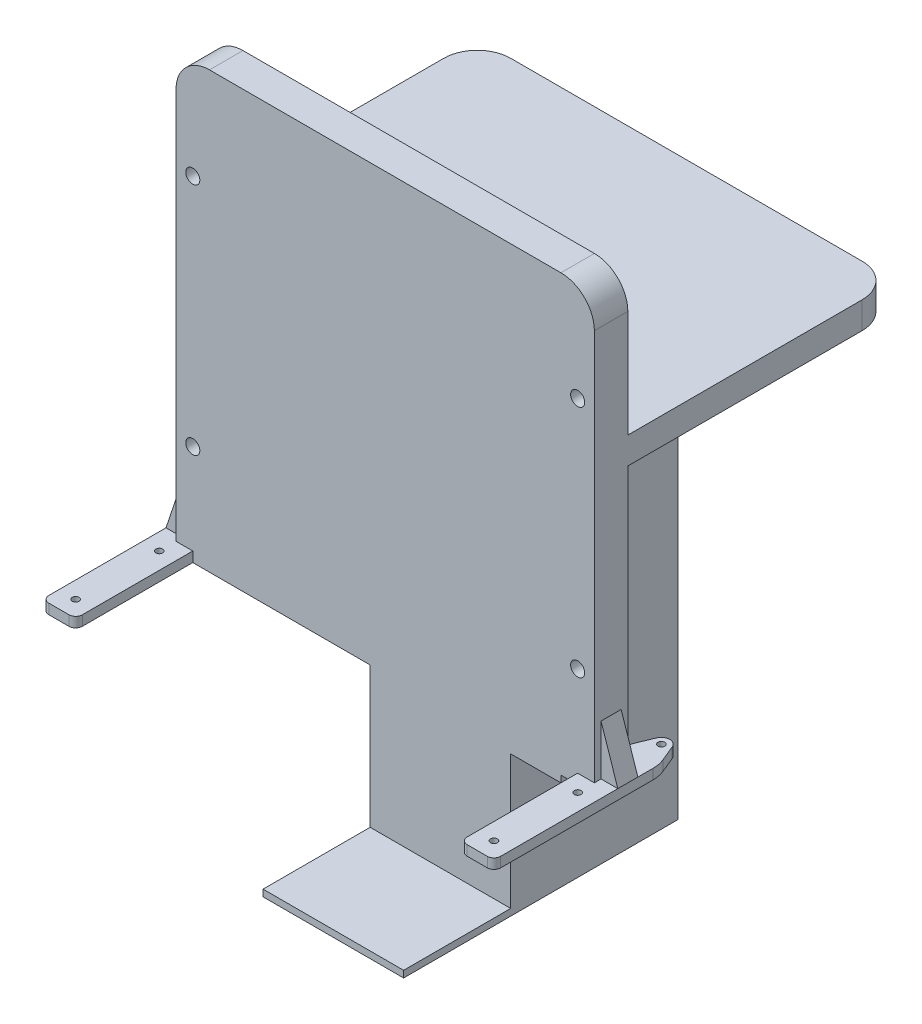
ISO-10303-21;
HEADER;
FILE_DESCRIPTION(('STEP AP214'),'2;1');
FILE_NAME('part.step','',(''),(''),'','','');
FILE_SCHEMA(('AUTOMOTIVE_DESIGN { 1 0 10303 214 1 1 1 1 }'));
ENDSEC;
DATA;
#1=APPLICATION_CONTEXT('core data for automotive mechanical design processes');
#2=APPLICATION_PROTOCOL_DEFINITION('international standard','automotive_design',2000,#1);
#3=PRODUCT_CONTEXT('',#1,'mechanical');
#4=PRODUCT('Part','Part','',(#3));
#5=PRODUCT_RELATED_PRODUCT_CATEGORY('part','',(#4));
#6=PRODUCT_DEFINITION_FORMATION('','',#4);
#7=PRODUCT_DEFINITION_CONTEXT('part definition',#1,'design');
#8=PRODUCT_DEFINITION('design','',#6,#7);
#9=PRODUCT_DEFINITION_SHAPE('','',#8);
#10=(LENGTH_UNIT() NAMED_UNIT(*) SI_UNIT(.MILLI.,.METRE.));
#11=(NAMED_UNIT(*) PLANE_ANGLE_UNIT() SI_UNIT($,.RADIAN.));
#12=(NAMED_UNIT(*) SI_UNIT($,.STERADIAN.) SOLID_ANGLE_UNIT());
#13=UNCERTAINTY_MEASURE_WITH_UNIT(LENGTH_MEASURE(1.E-05),#10,'distance_accuracy_value','');
#14=(GEOMETRIC_REPRESENTATION_CONTEXT(3) GLOBAL_UNCERTAINTY_ASSIGNED_CONTEXT((#13)) GLOBAL_UNIT_ASSIGNED_CONTEXT((#10,
#11,#12)) REPRESENTATION_CONTEXT('',''));
#15=CARTESIAN_POINT('',(0.,0.,0.));
#16=DIRECTION('',(0.,0.,1.));
#17=DIRECTION('',(1.,0.,0.));
#18=AXIS2_PLACEMENT_3D('',#15,#16,#17);
#19=CARTESIAN_POINT('',(0.,0.,-40.));
#20=DIRECTION('',(0.,0.,-1.));
#21=DIRECTION('',(-1.,0.,0.));
#22=AXIS2_PLACEMENT_3D('',#19,#20,#21);
#23=PLANE('',#22);
#24=DIRECTION('',(1.,0.,0.));
#25=VECTOR('',#24,1.);
#26=CARTESIAN_POINT('',(37.5,-42.,-40.));
#27=LINE('',#26,#25);
#28=CARTESIAN_POINT('',(-4.49999999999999,-42.,-40.));
#29=VERTEX_POINT('',#28);
#30=CARTESIAN_POINT('',(27.5,-42.,-40.));
#31=VERTEX_POINT('',#30);
#32=EDGE_CURVE('E882',#29,#31,#27,.T.);
#33=ORIENTED_EDGE('',*,*,#32,.F.);
#34=DIRECTION('',(0.,1.,0.));
#35=VECTOR('',#34,1.);
#36=CARTESIAN_POINT('',(-4.49999999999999,0.,-40.));
#37=LINE('',#36,#35);
#38=CARTESIAN_POINT('',(-4.49999999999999,0.,-40.));
#39=VERTEX_POINT('',#38);
#40=EDGE_CURVE('E800',#29,#39,#37,.T.);
#41=ORIENTED_EDGE('',*,*,#40,.T.);
#42=DIRECTION('',(-1.,0.,0.));
#43=VECTOR('',#42,1.);
#44=CARTESIAN_POINT('',(0.,0.,-40.));
#45=LINE('',#44,#43);
#46=CARTESIAN_POINT('',(-27.5,0.,-40.));
#47=VERTEX_POINT('',#46);
#48=EDGE_CURVE('E790',#39,#47,#45,.T.);
#49=ORIENTED_EDGE('',*,*,#48,.T.);
#50=DIRECTION('',(0.,1.,0.));
#51=VECTOR('',#50,1.);
#52=CARTESIAN_POINT('',(-27.5,0.,-40.));
#53=LINE('',#52,#51);
#54=CARTESIAN_POINT('',(-27.5,80.,-40.));
#55=VERTEX_POINT('',#54);
#56=EDGE_CURVE('E798',#47,#55,#53,.T.);
#57=ORIENTED_EDGE('',*,*,#56,.T.);
#58=DIRECTION('',(-1.,0.,0.));
#59=VECTOR('',#58,1.);
#60=CARTESIAN_POINT('',(-62.5,80.,-40.));
#61=LINE('',#60,#59);
#62=CARTESIAN_POINT('',(27.5,80.,-40.));
#63=VERTEX_POINT('',#62);
#64=EDGE_CURVE('E504',#63,#55,#61,.T.);
#65=ORIENTED_EDGE('',*,*,#64,.F.);
#66=DIRECTION('',(0.,-1.,0.));
#67=VECTOR('',#66,1.);
#68=CARTESIAN_POINT('',(27.5,0.,-40.));
#69=LINE('',#68,#67);
#70=EDGE_CURVE('E1042',#63,#31,#69,.T.);
#71=ORIENTED_EDGE('',*,*,#70,.T.);
#72=EDGE_LOOP('',(#33,#41,#49,#57,#65,#71));
#73=FACE_BOUND('',#72,.T.);
#74=ADVANCED_FACE('F39',(#73),#23,.T.);
#75=CARTESIAN_POINT('',(37.5,-42.,-80.));
#76=DIRECTION('',(0.,-1.,0.));
#77=DIRECTION('',(0.,0.,-1.));
#78=AXIS2_PLACEMENT_3D('',#75,#76,#77);
#79=PLANE('',#78);
#80=DIRECTION('',(0.,0.,-1.));
#81=VECTOR('',#80,1.);
#82=CARTESIAN_POINT('',(-4.49999999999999,-42.,-80.));
#83=LINE('',#82,#81);
#84=CARTESIAN_POINT('',(-4.49999999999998,-42.,-75.));
#85=VERTEX_POINT('',#84);
#86=EDGE_CURVE('E1034',#29,#85,#83,.T.);
#87=ORIENTED_EDGE('',*,*,#86,.F.);
#88=ORIENTED_EDGE('',*,*,#32,.T.);
#89=DIRECTION('',(0.,0.,1.));
#90=VECTOR('',#89,1.);
#91=CARTESIAN_POINT('',(27.5,-42.,-80.));
#92=LINE('',#91,#90);
#93=CARTESIAN_POINT('',(27.5,-42.,-80.));
#94=VERTEX_POINT('',#93);
#95=EDGE_CURVE('E1045',#94,#31,#92,.T.);
#96=ORIENTED_EDGE('',*,*,#95,.F.);
#97=DIRECTION('',(1.,0.,0.));
#98=VECTOR('',#97,1.);
#99=CARTESIAN_POINT('',(37.5,-42.,-80.));
#100=LINE('',#99,#98);
#101=CARTESIAN_POINT('',(-27.5,-42.,-80.));
#102=VERTEX_POINT('',#101);
#103=EDGE_CURVE('E889',#102,#94,#100,.T.);
#104=ORIENTED_EDGE('',*,*,#103,.F.);
#105=DIRECTION('',(0.,0.,-1.));
#106=VECTOR('',#105,1.);
#107=CARTESIAN_POINT('',(-27.5,-42.,-80.));
#108=LINE('',#107,#106);
#109=CARTESIAN_POINT('',(-27.5,-42.,-75.));
#110=VERTEX_POINT('',#109);
#111=EDGE_CURVE('E808',#110,#102,#108,.T.);
#112=ORIENTED_EDGE('',*,*,#111,.F.);
#113=DIRECTION('',(-1.,0.,0.));
#114=VECTOR('',#113,1.);
#115=CARTESIAN_POINT('',(37.5,-42.,-75.));
#116=LINE('',#115,#114);
#117=EDGE_CURVE('E61',#85,#110,#116,.T.);
#118=ORIENTED_EDGE('',*,*,#117,.F.);
#119=EDGE_LOOP('',(#87,#88,#96,#104,#112,#118));
#120=FACE_BOUND('',#119,.T.);
#121=ADVANCED_FACE('F1100',(#120),#79,.F.);
#122=CARTESIAN_POINT('',(-57.5,30.,-40.));
#123=DIRECTION('',(0.,0.,-1.));
#124=DIRECTION('',(-1.,0.,0.));
#125=AXIS2_PLACEMENT_3D('',#122,#123,#124);
#126=CIRCLE('',#125,2.09999999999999);
#127=CARTESIAN_POINT('',(-59.6,30.,-40.));
#128=VERTEX_POINT('',#127);
#129=EDGE_CURVE('E838',#128,#128,#126,.T.);
#130=ORIENTED_EDGE('',*,*,#129,.F.);
#131=EDGE_LOOP('',(#130));
#132=FACE_BOUND('',#131,.T.);
#133=DIRECTION('',(0.,1.,0.));
#134=VECTOR('',#133,1.);
#135=CARTESIAN_POINT('',(-37.5,0.,-40.));
#136=LINE('',#135,#134);
#137=CARTESIAN_POINT('',(-37.5,0.,-40.));
#138=VERTEX_POINT('',#137);
#139=CARTESIAN_POINT('',(-37.5,80.,-40.));
#140=VERTEX_POINT('',#139);
#141=EDGE_CURVE('E810',#138,#140,#136,.T.);
#142=ORIENTED_EDGE('',*,*,#141,.F.);
#143=DIRECTION('',(1.,0.,0.));
#144=VECTOR('',#143,1.);
#145=CARTESIAN_POINT('',(62.5,0.,-40.));
#146=LINE('',#145,#144);
#147=CARTESIAN_POINT('',(-57.5,0.,-40.));
#148=VERTEX_POINT('',#147);
#149=EDGE_CURVE('E648',#148,#138,#146,.T.);
#150=ORIENTED_EDGE('',*,*,#149,.F.);
#151=DIRECTION('',(0.,-1.,0.));
#152=VECTOR('',#151,1.);
#153=CARTESIAN_POINT('',(-57.5,3.,-40.));
#154=LINE('',#153,#152);
#155=CARTESIAN_POINT('',(-57.5,3.,-40.));
#156=VERTEX_POINT('',#155);
#157=EDGE_CURVE('E657',#156,#148,#154,.T.);
#158=ORIENTED_EDGE('',*,*,#157,.F.);
#159=DIRECTION('',(-1.,0.,0.));
#160=VECTOR('',#159,1.);
#161=CARTESIAN_POINT('',(-67.5,3.,-40.));
#162=LINE('',#161,#160);
#163=CARTESIAN_POINT('',(-62.5,3.,-40.));
#164=VERTEX_POINT('',#163);
#165=EDGE_CURVE('E644',#156,#164,#162,.T.);
#166=ORIENTED_EDGE('',*,*,#165,.T.);
#167=DIRECTION('',(0.,-1.,0.));
#168=VECTOR('',#167,1.);
#169=CARTESIAN_POINT('',(-62.5,130.,-40.));
#170=LINE('',#169,#168);
#171=CARTESIAN_POINT('',(-62.5,80.,-40.));
#172=VERTEX_POINT('',#171);
#173=EDGE_CURVE('E632',#172,#164,#170,.T.);
#174=ORIENTED_EDGE('',*,*,#173,.F.);
#175=EDGE_CURVE('E475',#140,#172,#61,.T.);
#176=ORIENTED_EDGE('',*,*,#175,.F.);
#177=EDGE_LOOP('',(#142,#150,#158,#166,#174,#176));
#178=FACE_BOUND('',#177,.T.);
#179=ADVANCED_FACE('F1068',(#132,#178),#23,.T.);
#180=CARTESIAN_POINT('',(0.,0.,-30.));
#181=DIRECTION('',(0.,0.,-1.));
#182=DIRECTION('',(-1.,0.,0.));
#183=AXIS2_PLACEMENT_3D('',#180,#181,#182);
#184=PLANE('',#183);
#185=CARTESIAN_POINT('',(-57.5,100.,-30.));
#186=DIRECTION('',(0.,0.,1.));
#187=DIRECTION('',(1.,0.,0.));
#188=AXIS2_PLACEMENT_3D('',#185,#186,#187);
#189=CIRCLE('',#188,2.09999999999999);
#190=CARTESIAN_POINT('',(-55.4,100.,-30.));
#191=VERTEX_POINT('',#190);
#192=EDGE_CURVE('E823',#191,#191,#189,.T.);
#193=ORIENTED_EDGE('',*,*,#192,.F.);
#194=EDGE_LOOP('',(#193));
#195=FACE_BOUND('',#194,.T.);
#196=CARTESIAN_POINT('',(-57.5,30.,-30.));
#197=DIRECTION('',(0.,0.,1.));
#198=DIRECTION('',(1.,0.,0.));
#199=AXIS2_PLACEMENT_3D('',#196,#197,#198);
#200=CIRCLE('',#199,2.09999999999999);
#201=CARTESIAN_POINT('',(-55.4,30.,-30.));
#202=VERTEX_POINT('',#201);
#203=EDGE_CURVE('E835',#202,#202,#200,.T.);
#204=ORIENTED_EDGE('',*,*,#203,.F.);
#205=EDGE_LOOP('',(#204));
#206=FACE_BOUND('',#205,.T.);
#207=CARTESIAN_POINT('',(57.5,100.,-30.));
#208=DIRECTION('',(0.,0.,1.));
#209=DIRECTION('',(1.,0.,0.));
#210=AXIS2_PLACEMENT_3D('',#207,#208,#209);
#211=CIRCLE('',#210,2.09999999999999);
#212=CARTESIAN_POINT('',(59.6,100.,-30.));
#213=VERTEX_POINT('',#212);
#214=EDGE_CURVE('E829',#213,#213,#211,.T.);
#215=ORIENTED_EDGE('',*,*,#214,.F.);
#216=EDGE_LOOP('',(#215));
#217=FACE_BOUND('',#216,.T.);
#218=CARTESIAN_POINT('',(57.5,30.,-30.));
#219=DIRECTION('',(0.,0.,1.));
#220=DIRECTION('',(1.,0.,0.));
#221=AXIS2_PLACEMENT_3D('',#218,#219,#220);
#222=CIRCLE('',#221,2.09999999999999);
#223=CARTESIAN_POINT('',(59.6,30.,-30.));
#224=VERTEX_POINT('',#223);
#225=EDGE_CURVE('E841',#224,#224,#222,.T.);
#226=ORIENTED_EDGE('',*,*,#225,.F.);
#227=EDGE_LOOP('',(#226));
#228=FACE_BOUND('',#227,.T.);
#229=DIRECTION('',(0.,1.,0.));
#230=VECTOR('',#229,1.);
#231=CARTESIAN_POINT('',(-4.49999999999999,0.,-30.));
#232=LINE('',#231,#230);
#233=CARTESIAN_POINT('',(-4.49999999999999,-42.,-30.));
#234=VERTEX_POINT('',#233);
#235=CARTESIAN_POINT('',(-4.49999999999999,0.,-30.));
#236=VERTEX_POINT('',#235);
#237=EDGE_CURVE('E913',#234,#236,#232,.T.);
#238=ORIENTED_EDGE('',*,*,#237,.F.);
#239=DIRECTION('',(-1.,0.,0.));
#240=VECTOR('',#239,1.);
#241=CARTESIAN_POINT('',(-37.5,-42.,-30.));
#242=LINE('',#241,#240);
#243=CARTESIAN_POINT('',(37.5,-42.,-30.));
#244=VERTEX_POINT('',#243);
#245=EDGE_CURVE('E892',#244,#234,#242,.T.);
#246=ORIENTED_EDGE('',*,*,#245,.F.);
#247=DIRECTION('',(0.,1.,0.));
#248=VECTOR('',#247,1.);
#249=CARTESIAN_POINT('',(37.5,-44.,-30.));
#250=LINE('',#249,#248);
#251=CARTESIAN_POINT('',(37.5,-2.,-30.));
#252=VERTEX_POINT('',#251);
#253=EDGE_CURVE('E442',#244,#252,#250,.T.);
#254=ORIENTED_EDGE('',*,*,#253,.T.);
#255=DIRECTION('',(1.,0.,0.));
#256=VECTOR('',#255,1.);
#257=CARTESIAN_POINT('',(52.5,-2.,-30.));
#258=LINE('',#257,#256);
#259=CARTESIAN_POINT('',(52.5,-2.,-30.));
#260=VERTEX_POINT('',#259);
#261=EDGE_CURVE('E450',#252,#260,#258,.T.);
#262=ORIENTED_EDGE('',*,*,#261,.T.);
#263=DIRECTION('',(0.,1.,0.));
#264=VECTOR('',#263,1.);
#265=CARTESIAN_POINT('',(52.5,0.,-30.));
#266=LINE('',#265,#264);
#267=CARTESIAN_POINT('',(52.5,0.,-30.));
#268=VERTEX_POINT('',#267);
#269=EDGE_CURVE('E452',#260,#268,#266,.T.);
#270=ORIENTED_EDGE('',*,*,#269,.T.);
#271=DIRECTION('',(1.,0.,0.));
#272=VECTOR('',#271,1.);
#273=CARTESIAN_POINT('',(62.5,0.,-30.));
#274=LINE('',#273,#272);
#275=CARTESIAN_POINT('',(57.5,0.,-30.));
#276=VERTEX_POINT('',#275);
#277=EDGE_CURVE('E635',#268,#276,#274,.T.);
#278=ORIENTED_EDGE('',*,*,#277,.T.);
#279=DIRECTION('',(0.,-1.,0.));
#280=VECTOR('',#279,1.);
#281=CARTESIAN_POINT('',(57.5,0.,-30.));
#282=LINE('',#281,#280);
#283=CARTESIAN_POINT('',(57.5,3.,-30.));
#284=VERTEX_POINT('',#283);
#285=EDGE_CURVE('E629',#284,#276,#282,.T.);
#286=ORIENTED_EDGE('',*,*,#285,.F.);
#287=DIRECTION('',(1.,0.,0.));
#288=VECTOR('',#287,1.);
#289=CARTESIAN_POINT('',(0.,3.,-30.));
#290=LINE('',#289,#288);
#291=CARTESIAN_POINT('',(62.5,3.,-30.));
#292=VERTEX_POINT('',#291);
#293=EDGE_CURVE('E627',#284,#292,#290,.T.);
#294=ORIENTED_EDGE('',*,*,#293,.T.);
#295=DIRECTION('',(0.,1.,0.));
#296=VECTOR('',#295,1.);
#297=CARTESIAN_POINT('',(62.5,130.,-30.));
#298=LINE('',#297,#296);
#299=CARTESIAN_POINT('',(62.5,120.,-30.));
#300=VERTEX_POINT('',#299);
#301=EDGE_CURVE('E639',#292,#300,#298,.T.);
#302=ORIENTED_EDGE('',*,*,#301,.T.);
#303=CARTESIAN_POINT('',(52.5,120.,-30.));
#304=DIRECTION('',(0.,0.,-1.));
#305=DIRECTION('',(-1.,0.,0.));
#306=AXIS2_PLACEMENT_3D('',#303,#304,#305);
#307=CIRCLE('',#306,10.);
#308=CARTESIAN_POINT('',(52.5,130.,-30.));
#309=VERTEX_POINT('',#308);
#310=EDGE_CURVE('E775',#300,#309,#307,.F.);
#311=ORIENTED_EDGE('',*,*,#310,.T.);
#312=DIRECTION('',(-1.,0.,0.));
#313=VECTOR('',#312,1.);
#314=CARTESIAN_POINT('',(62.5,130.,-30.));
#315=LINE('',#314,#313);
#316=CARTESIAN_POINT('',(-52.5,130.,-30.));
#317=VERTEX_POINT('',#316);
#318=EDGE_CURVE('E642',#309,#317,#315,.T.);
#319=ORIENTED_EDGE('',*,*,#318,.T.);
#320=CARTESIAN_POINT('',(-52.5,120.,-30.));
#321=DIRECTION('',(0.,0.,-1.));
#322=DIRECTION('',(-1.,0.,0.));
#323=AXIS2_PLACEMENT_3D('',#320,#321,#322);
#324=CIRCLE('',#323,10.);
#325=CARTESIAN_POINT('',(-62.5,120.,-30.));
#326=VERTEX_POINT('',#325);
#327=EDGE_CURVE('E777',#317,#326,#324,.F.);
#328=ORIENTED_EDGE('',*,*,#327,.T.);
#329=DIRECTION('',(0.,-1.,0.));
#330=VECTOR('',#329,1.);
#331=CARTESIAN_POINT('',(-62.5,130.,-30.));
#332=LINE('',#331,#330);
#333=CARTESIAN_POINT('',(-62.5,3.,-30.));
#334=VERTEX_POINT('',#333);
#335=EDGE_CURVE('E633',#326,#334,#332,.T.);
#336=ORIENTED_EDGE('',*,*,#335,.T.);
#337=DIRECTION('',(-1.,0.,0.));
#338=VECTOR('',#337,1.);
#339=CARTESIAN_POINT('',(-67.5,3.,-30.));
#340=LINE('',#339,#338);
#341=CARTESIAN_POINT('',(-57.5,3.,-30.));
#342=VERTEX_POINT('',#341);
#343=EDGE_CURVE('E659',#342,#334,#340,.T.);
#344=ORIENTED_EDGE('',*,*,#343,.F.);
#345=DIRECTION('',(0.,-1.,0.));
#346=VECTOR('',#345,1.);
#347=CARTESIAN_POINT('',(-57.5,3.,-30.));
#348=LINE('',#347,#346);
#349=CARTESIAN_POINT('',(-57.5,0.,-30.));
#350=VERTEX_POINT('',#349);
#351=EDGE_CURVE('E662',#342,#350,#348,.T.);
#352=ORIENTED_EDGE('',*,*,#351,.T.);
#353=EDGE_CURVE('E637',#350,#236,#274,.T.);
#354=ORIENTED_EDGE('',*,*,#353,.T.);
#355=EDGE_LOOP('',(#238,#246,#254,#262,#270,#278,#286,#294,#302,#311,#319,#328,#336,#344,#352,#354));
#356=FACE_BOUND('',#355,.T.);
#357=ADVANCED_FACE('F910',(#195,#206,#217,#228,#356),#184,.F.);
#358=CARTESIAN_POINT('',(-37.5,-44.,-40.));
#359=DIRECTION('',(1.,0.,0.));
#360=DIRECTION('',(0.,0.,-1.));
#361=AXIS2_PLACEMENT_3D('',#358,#359,#360);
#362=PLANE('',#361);
#363=DIRECTION('',(0.,0.,-1.));
#364=VECTOR('',#363,1.);
#365=CARTESIAN_POINT('',(-37.5,0.,-40.));
#366=LINE('',#365,#364);
#367=CARTESIAN_POINT('',(-37.5,0.,-75.));
#368=VERTEX_POINT('',#367);
#369=EDGE_CURVE('E801',#138,#368,#366,.T.);
#370=ORIENTED_EDGE('',*,*,#369,.F.);
#371=ORIENTED_EDGE('',*,*,#141,.T.);
#372=DIRECTION('',(0.,0.,1.));
#373=VECTOR('',#372,1.);
#374=CARTESIAN_POINT('',(-37.5,80.,-120.));
#375=LINE('',#374,#373);
#376=CARTESIAN_POINT('',(-37.5,80.,-80.));
#377=VERTEX_POINT('',#376);
#378=EDGE_CURVE('E817',#377,#140,#375,.T.);
#379=ORIENTED_EDGE('',*,*,#378,.F.);
#380=DIRECTION('',(0.,1.,0.));
#381=VECTOR('',#380,1.);
#382=CARTESIAN_POINT('',(-37.5,-44.,-80.));
#383=LINE('',#382,#381);
#384=CARTESIAN_POINT('',(-37.5,-44.,-80.));
#385=VERTEX_POINT('',#384);
#386=EDGE_CURVE('E437',#385,#377,#383,.T.);
#387=ORIENTED_EDGE('',*,*,#386,.F.);
#388=DIRECTION('',(0.,0.,-1.));
#389=VECTOR('',#388,1.);
#390=CARTESIAN_POINT('',(-37.5,-44.,-40.));
#391=LINE('',#390,#389);
#392=CARTESIAN_POINT('',(-37.5,-44.,-75.));
#393=VERTEX_POINT('',#392);
#394=EDGE_CURVE('E429',#393,#385,#391,.T.);
#395=ORIENTED_EDGE('',*,*,#394,.F.);
#396=DIRECTION('',(0.,-1.,0.));
#397=VECTOR('',#396,1.);
#398=CARTESIAN_POINT('',(-37.5,-44.,-75.));
#399=LINE('',#398,#397);
#400=EDGE_CURVE('E415',#368,#393,#399,.T.);
#401=ORIENTED_EDGE('',*,*,#400,.F.);
#402=EDGE_LOOP('',(#370,#371,#379,#387,#395,#401));
#403=FACE_BOUND('',#402,.T.);
#404=ADVANCED_FACE('F435',(#403),#362,.F.);
#405=CARTESIAN_POINT('',(0.,-44.,0.));
#406=DIRECTION('',(0.,1.,0.));
#407=DIRECTION('',(0.,0.,1.));
#408=AXIS2_PLACEMENT_3D('',#405,#406,#407);
#409=PLANE('',#408);
#410=DIRECTION('',(0.,0.,-1.));
#411=VECTOR('',#410,1.);
#412=CARTESIAN_POINT('',(-4.49999999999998,-44.,5.));
#413=LINE('',#412,#411);
#414=CARTESIAN_POINT('',(-4.49999999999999,-44.,2.));
#415=VERTEX_POINT('',#414);
#416=CARTESIAN_POINT('',(-4.49999999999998,-44.,-75.));
#417=VERTEX_POINT('',#416);
#418=EDGE_CURVE('E53',#415,#417,#413,.T.);
#419=ORIENTED_EDGE('',*,*,#418,.T.);
#420=DIRECTION('',(1.,0.,0.));
#421=VECTOR('',#420,1.);
#422=CARTESIAN_POINT('',(-4.49999999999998,-44.,-75.));
#423=LINE('',#422,#421);
#424=EDGE_CURVE('E418',#393,#417,#423,.T.);
#425=ORIENTED_EDGE('',*,*,#424,.F.);
#426=ORIENTED_EDGE('',*,*,#394,.T.);
#427=DIRECTION('',(-1.,0.,0.));
#428=VECTOR('',#427,1.);
#429=CARTESIAN_POINT('',(37.5,-44.,-80.));
#430=LINE('',#429,#428);
#431=CARTESIAN_POINT('',(37.5,-44.,-80.));
#432=VERTEX_POINT('',#431);
#433=EDGE_CURVE('E886',#432,#385,#430,.T.);
#434=ORIENTED_EDGE('',*,*,#433,.F.);
#435=DIRECTION('',(0.,0.,1.));
#436=VECTOR('',#435,1.);
#437=CARTESIAN_POINT('',(37.5,-44.,-40.));
#438=LINE('',#437,#436);
#439=CARTESIAN_POINT('',(37.5,-44.,2.));
#440=VERTEX_POINT('',#439);
#441=EDGE_CURVE('E438',#432,#440,#438,.T.);
#442=ORIENTED_EDGE('',*,*,#441,.T.);
#443=DIRECTION('',(1.,0.,0.));
#444=VECTOR('',#443,1.);
#445=CARTESIAN_POINT('',(-37.5,-44.,2.));
#446=LINE('',#445,#444);
#447=EDGE_CURVE('E894',#415,#440,#446,.T.);
#448=ORIENTED_EDGE('',*,*,#447,.F.);
#449=EDGE_LOOP('',(#419,#425,#426,#434,#442,#448));
#450=FACE_BOUND('',#449,.T.);
#451=ADVANCED_FACE('F427',(#450),#409,.F.);
#452=CARTESIAN_POINT('',(-37.5,-42.,2.));
#453=DIRECTION('',(0.,-1.,0.));
#454=DIRECTION('',(0.,0.,-1.));
#455=AXIS2_PLACEMENT_3D('',#452,#453,#454);
#456=PLANE('',#455);
#457=DIRECTION('',(0.,0.,-1.));
#458=VECTOR('',#457,1.);
#459=CARTESIAN_POINT('',(-4.49999999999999,-42.,2.));
#460=LINE('',#459,#458);
#461=CARTESIAN_POINT('',(-4.49999999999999,-42.,2.));
#462=VERTEX_POINT('',#461);
#463=EDGE_CURVE('E905',#462,#234,#460,.T.);
#464=ORIENTED_EDGE('',*,*,#463,.F.);
#465=DIRECTION('',(-1.,0.,0.));
#466=VECTOR('',#465,1.);
#467=CARTESIAN_POINT('',(-37.5,-42.,2.));
#468=LINE('',#467,#466);
#469=CARTESIAN_POINT('',(37.5,-42.,2.));
#470=VERTEX_POINT('',#469);
#471=EDGE_CURVE('E444',#470,#462,#468,.T.);
#472=ORIENTED_EDGE('',*,*,#471,.F.);
#473=DIRECTION('',(0.,0.,-1.));
#474=VECTOR('',#473,1.);
#475=CARTESIAN_POINT('',(37.5,-42.,2.));
#476=LINE('',#475,#474);
#477=EDGE_CURVE('E439',#470,#244,#476,.T.);
#478=ORIENTED_EDGE('',*,*,#477,.T.);
#479=ORIENTED_EDGE('',*,*,#245,.T.);
#480=EDGE_LOOP('',(#464,#472,#478,#479));
#481=FACE_BOUND('',#480,.T.);
#482=ADVANCED_FACE('F903',(#481),#456,.F.);
#483=CARTESIAN_POINT('',(0.,0.,2.));
#484=DIRECTION('',(0.,0.,-1.));
#485=DIRECTION('',(-1.,0.,0.));
#486=AXIS2_PLACEMENT_3D('',#483,#484,#485);
#487=PLANE('',#486);
#488=DIRECTION('',(0.,1.,0.));
#489=VECTOR('',#488,1.);
#490=CARTESIAN_POINT('',(-4.49999999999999,0.,2.));
#491=LINE('',#490,#489);
#492=EDGE_CURVE('E11',#415,#462,#491,.T.);
#493=ORIENTED_EDGE('',*,*,#492,.F.);
#494=ORIENTED_EDGE('',*,*,#447,.T.);
#495=DIRECTION('',(0.,1.,0.));
#496=VECTOR('',#495,1.);
#497=CARTESIAN_POINT('',(37.5,-44.,2.));
#498=LINE('',#497,#496);
#499=EDGE_CURVE('E896',#440,#470,#498,.T.);
#500=ORIENTED_EDGE('',*,*,#499,.T.);
#501=ORIENTED_EDGE('',*,*,#471,.T.);
#502=EDGE_LOOP('',(#493,#494,#500,#501));
#503=FACE_BOUND('',#502,.T.);
#504=ADVANCED_FACE('F1126',(#503),#487,.F.);
#505=CARTESIAN_POINT('',(-27.5,43.,-57.5));
#506=DIRECTION('',(-1.,0.,0.));
#507=DIRECTION('',(0.,0.,1.));
#508=AXIS2_PLACEMENT_3D('',#505,#506,#507);
#509=PLANE('',#508);
#510=DIRECTION('',(0.,0.,1.));
#511=VECTOR('',#510,1.);
#512=CARTESIAN_POINT('',(-27.5,0.,-57.5));
#513=LINE('',#512,#511);
#514=CARTESIAN_POINT('',(-27.5,0.,-75.));
#515=VERTEX_POINT('',#514);
#516=EDGE_CURVE('E47',#515,#47,#513,.T.);
#517=ORIENTED_EDGE('',*,*,#516,.F.);
#518=DIRECTION('',(0.,1.,0.));
#519=VECTOR('',#518,1.);
#520=CARTESIAN_POINT('',(-27.5,43.,-75.));
#521=LINE('',#520,#519);
#522=EDGE_CURVE('E779',#110,#515,#521,.T.);
#523=ORIENTED_EDGE('',*,*,#522,.F.);
#524=ORIENTED_EDGE('',*,*,#111,.T.);
#525=DIRECTION('',(0.,1.,0.));
#526=VECTOR('',#525,1.);
#527=CARTESIAN_POINT('',(-27.5,43.,-80.));
#528=LINE('',#527,#526);
#529=CARTESIAN_POINT('',(-27.5,80.,-80.));
#530=VERTEX_POINT('',#529);
#531=EDGE_CURVE('E812',#102,#530,#528,.T.);
#532=ORIENTED_EDGE('',*,*,#531,.T.);
#533=DIRECTION('',(0.,0.,1.));
#534=VECTOR('',#533,1.);
#535=CARTESIAN_POINT('',(-27.5,80.,-120.));
#536=LINE('',#535,#534);
#537=EDGE_CURVE('E807',#530,#55,#536,.T.);
#538=ORIENTED_EDGE('',*,*,#537,.T.);
#539=ORIENTED_EDGE('',*,*,#56,.F.);
#540=EDGE_LOOP('',(#517,#523,#524,#532,#538,#539));
#541=FACE_BOUND('',#540,.T.);
#542=ADVANCED_FACE('F804',(#541),#509,.F.);
#543=DIRECTION('',(0.,-1.,0.));
#544=VECTOR('',#543,1.);
#545=CARTESIAN_POINT('',(37.5,0.,-40.));
#546=LINE('',#545,#544);
#547=CARTESIAN_POINT('',(37.5,80.,-40.));
#548=VERTEX_POINT('',#547);
#549=CARTESIAN_POINT('',(37.5,-2.,-40.));
#550=VERTEX_POINT('',#549);
#551=EDGE_CURVE('E919',#548,#550,#546,.T.);
#552=ORIENTED_EDGE('',*,*,#551,.F.);
#553=CARTESIAN_POINT('',(62.5,80.,-40.));
#554=VERTEX_POINT('',#553);
#555=EDGE_CURVE('E501',#554,#548,#61,.T.);
#556=ORIENTED_EDGE('',*,*,#555,.F.);
#557=DIRECTION('',(0.,1.,0.));
#558=VECTOR('',#557,1.);
#559=CARTESIAN_POINT('',(62.5,130.,-40.));
#560=LINE('',#559,#558);
#561=CARTESIAN_POINT('',(62.5,3.,-40.));
#562=VERTEX_POINT('',#561);
#563=EDGE_CURVE('E651',#562,#554,#560,.T.);
#564=ORIENTED_EDGE('',*,*,#563,.F.);
#565=DIRECTION('',(1.,0.,0.));
#566=VECTOR('',#565,1.);
#567=CARTESIAN_POINT('',(0.,3.,-40.));
#568=LINE('',#567,#566);
#569=CARTESIAN_POINT('',(57.5,3.,-40.));
#570=VERTEX_POINT('',#569);
#571=EDGE_CURVE('E620',#570,#562,#568,.T.);
#572=ORIENTED_EDGE('',*,*,#571,.F.);
#573=DIRECTION('',(0.,-1.,0.));
#574=VECTOR('',#573,1.);
#575=CARTESIAN_POINT('',(57.5,0.,-40.));
#576=LINE('',#575,#574);
#577=CARTESIAN_POINT('',(57.5,0.,-40.));
#578=VERTEX_POINT('',#577);
#579=EDGE_CURVE('E738',#570,#578,#576,.T.);
#580=ORIENTED_EDGE('',*,*,#579,.T.);
#581=CARTESIAN_POINT('',(52.5,0.,-40.));
#582=VERTEX_POINT('',#581);
#583=EDGE_CURVE('E647',#582,#578,#146,.T.);
#584=ORIENTED_EDGE('',*,*,#583,.F.);
#585=DIRECTION('',(0.,1.,0.));
#586=VECTOR('',#585,1.);
#587=CARTESIAN_POINT('',(52.5,0.,-40.));
#588=LINE('',#587,#586);
#589=CARTESIAN_POINT('',(52.5,-2.,-40.));
#590=VERTEX_POINT('',#589);
#591=EDGE_CURVE('E453',#590,#582,#588,.T.);
#592=ORIENTED_EDGE('',*,*,#591,.F.);
#593=DIRECTION('',(1.,0.,0.));
#594=VECTOR('',#593,1.);
#595=CARTESIAN_POINT('',(52.5,-2.,-40.));
#596=LINE('',#595,#594);
#597=EDGE_CURVE('E449',#550,#590,#596,.T.);
#598=ORIENTED_EDGE('',*,*,#597,.F.);
#599=EDGE_LOOP('',(#552,#556,#564,#572,#580,#584,#592,#598));
#600=FACE_BOUND('',#599,.T.);
#601=CARTESIAN_POINT('',(57.5,30.,-40.));
#602=DIRECTION('',(0.,0.,-1.));
#603=DIRECTION('',(-1.,0.,0.));
#604=AXIS2_PLACEMENT_3D('',#601,#602,#603);
#605=CIRCLE('',#604,2.09999999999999);
#606=CARTESIAN_POINT('',(55.4,30.,-40.));
#607=VERTEX_POINT('',#606);
#608=EDGE_CURVE('E844',#607,#607,#605,.T.);
#609=ORIENTED_EDGE('',*,*,#608,.F.);
#610=EDGE_LOOP('',(#609));
#611=FACE_BOUND('',#610,.T.);
#612=ADVANCED_FACE('F926',(#600,#611),#23,.T.);
#613=CARTESIAN_POINT('',(-67.5,0.,-42.4726233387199));
#614=DIRECTION('',(0.,1.,0.));
#615=DIRECTION('',(0.,0.,1.));
#616=AXIS2_PLACEMENT_3D('',#613,#614,#615);
#617=PLANE('',#616);
#618=CARTESIAN_POINT('',(-62.5,0.,0.));
#619=DIRECTION('',(0.,1.,0.));
#620=DIRECTION('',(0.,0.,1.));
#621=AXIS2_PLACEMENT_3D('',#618,#619,#620);
#622=CIRCLE('',#621,1.025);
#623=CARTESIAN_POINT('',(-62.5,0.,1.025));
#624=VERTEX_POINT('',#623);
#625=EDGE_CURVE('E879',#624,#624,#622,.T.);
#626=ORIENTED_EDGE('',*,*,#625,.T.);
#627=EDGE_LOOP('',(#626));
#628=FACE_BOUND('',#627,.T.);
#629=CARTESIAN_POINT('',(-62.5,0.,-50.));
#630=DIRECTION('',(0.,1.,0.));
#631=DIRECTION('',(0.,0.,1.));
#632=AXIS2_PLACEMENT_3D('',#629,#630,#631);
#633=CIRCLE('',#632,1.025);
#634=CARTESIAN_POINT('',(-62.5,0.,-48.975));
#635=VERTEX_POINT('',#634);
#636=EDGE_CURVE('E678',#635,#635,#633,.T.);
#637=ORIENTED_EDGE('',*,*,#636,.T.);
#638=EDGE_LOOP('',(#637));
#639=FACE_BOUND('',#638,.T.);
#640=CARTESIAN_POINT('',(-62.5,0.,-25.));
#641=DIRECTION('',(0.,1.,0.));
#642=DIRECTION('',(0.,0.,1.));
#643=AXIS2_PLACEMENT_3D('',#640,#641,#642);
#644=CIRCLE('',#643,1.025);
#645=CARTESIAN_POINT('',(-62.5,0.,-23.975));
#646=VERTEX_POINT('',#645);
#647=EDGE_CURVE('E672',#646,#646,#644,.T.);
#648=ORIENTED_EDGE('',*,*,#647,.T.);
#649=EDGE_LOOP('',(#648));
#650=FACE_BOUND('',#649,.T.);
#651=ORIENTED_EDGE('',*,*,#149,.T.);
#652=ORIENTED_EDGE('',*,*,#369,.T.);
#653=DIRECTION('',(-1.,0.,0.));
#654=VECTOR('',#653,1.);
#655=CARTESIAN_POINT('',(-52.5,0.,-75.));
#656=LINE('',#655,#654);
#657=EDGE_CURVE('E420',#515,#368,#656,.T.);
#658=ORIENTED_EDGE('',*,*,#657,.F.);
#659=ORIENTED_EDGE('',*,*,#516,.T.);
#660=ORIENTED_EDGE('',*,*,#48,.F.);
#661=DIRECTION('',(0.,0.,-1.));
#662=VECTOR('',#661,1.);
#663=CARTESIAN_POINT('',(-4.49999999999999,0.,5.));
#664=LINE('',#663,#662);
#665=EDGE_CURVE('E1024',#236,#39,#664,.T.);
#666=ORIENTED_EDGE('',*,*,#665,.F.);
#667=ORIENTED_EDGE('',*,*,#353,.F.);
#668=DIRECTION('',(0.,0.,-1.));
#669=VECTOR('',#668,1.);
#670=CARTESIAN_POINT('',(-57.5,0.,-42.4726233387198));
#671=LINE('',#670,#669);
#672=CARTESIAN_POINT('',(-57.5,0.,2.99999999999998));
#673=VERTEX_POINT('',#672);
#674=EDGE_CURVE('E686',#673,#350,#671,.T.);
#675=ORIENTED_EDGE('',*,*,#674,.F.);
#676=CARTESIAN_POINT('',(-59.5,0.,3.));
#677=DIRECTION('',(0.,1.,0.));
#678=DIRECTION('',(0.,0.,1.));
#679=AXIS2_PLACEMENT_3D('',#676,#677,#678);
#680=CIRCLE('',#679,2.);
#681=CARTESIAN_POINT('',(-59.5,0.,5.));
#682=VERTEX_POINT('',#681);
#683=EDGE_CURVE('E473',#673,#682,#680,.F.);
#684=ORIENTED_EDGE('',*,*,#683,.T.);
#685=DIRECTION('',(-1.,0.,0.));
#686=VECTOR('',#685,1.);
#687=CARTESIAN_POINT('',(-65.5,0.,5.));
#688=LINE('',#687,#686);
#689=CARTESIAN_POINT('',(-65.5,0.,5.));
#690=VERTEX_POINT('',#689);
#691=EDGE_CURVE('E470',#682,#690,#688,.T.);
#692=ORIENTED_EDGE('',*,*,#691,.T.);
#693=CARTESIAN_POINT('',(-65.5,0.,3.));
#694=DIRECTION('',(0.,1.,0.));
#695=DIRECTION('',(0.,0.,1.));
#696=AXIS2_PLACEMENT_3D('',#693,#694,#695);
#697=CIRCLE('',#696,2.);
#698=CARTESIAN_POINT('',(-67.5,0.,2.99999999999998));
#699=VERTEX_POINT('',#698);
#700=EDGE_CURVE('E467',#690,#699,#697,.F.);
#701=ORIENTED_EDGE('',*,*,#700,.T.);
#702=DIRECTION('',(0.,0.,1.));
#703=VECTOR('',#702,1.);
#704=CARTESIAN_POINT('',(-67.5,0.,-42.4726233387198));
#705=LINE('',#704,#703);
#706=CARTESIAN_POINT('',(-67.5,0.,-42.4726233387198));
#707=VERTEX_POINT('',#706);
#708=EDGE_CURVE('E713',#707,#699,#705,.T.);
#709=ORIENTED_EDGE('',*,*,#708,.F.);
#710=CARTESIAN_POINT('',(-57.5,0.,-42.4726233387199));
#711=DIRECTION('',(0.,1.,0.));
#712=DIRECTION('',(0.,0.,1.));
#713=AXIS2_PLACEMENT_3D('',#710,#711,#712);
#714=CIRCLE('',#713,10.);
#715=CARTESIAN_POINT('',(-66.7387953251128,0.,-46.2994576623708));
#716=VERTEX_POINT('',#715);
#717=EDGE_CURVE('E711',#716,#707,#714,.T.);
#718=ORIENTED_EDGE('',*,*,#717,.F.);
#719=DIRECTION('',(-0.382683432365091,0.,0.923879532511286));
#720=VECTOR('',#719,1.);
#721=CARTESIAN_POINT('',(-64.8096988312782,0.,-50.9567085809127));
#722=LINE('',#721,#720);
#723=CARTESIAN_POINT('',(-64.8096988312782,0.,-50.9567085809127));
#724=VERTEX_POINT('',#723);
#725=EDGE_CURVE('E709',#724,#716,#722,.T.);
#726=ORIENTED_EDGE('',*,*,#725,.F.);
#727=CARTESIAN_POINT('',(-62.5,0.,-50.));
#728=DIRECTION('',(0.,1.,0.));
#729=DIRECTION('',(0.,0.,1.));
#730=AXIS2_PLACEMENT_3D('',#727,#728,#729);
#731=CIRCLE('',#730,2.5);
#732=CARTESIAN_POINT('',(-60.1903011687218,0.,-50.9567085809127));
#733=VERTEX_POINT('',#732);
#734=EDGE_CURVE('E707',#733,#724,#731,.T.);
#735=ORIENTED_EDGE('',*,*,#734,.F.);
#736=DIRECTION('',(-0.382683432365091,0.,-0.923879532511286));
#737=VECTOR('',#736,1.);
#738=CARTESIAN_POINT('',(-60.1903011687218,0.,-50.9567085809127));
#739=LINE('',#738,#737);
#740=CARTESIAN_POINT('',(-58.2612046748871,0.,-46.2994576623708));
#741=VERTEX_POINT('',#740);
#742=EDGE_CURVE('E705',#741,#733,#739,.T.);
#743=ORIENTED_EDGE('',*,*,#742,.F.);
#744=CARTESIAN_POINT('',(-67.5,0.,-42.4726233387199));
#745=DIRECTION('',(0.,1.,0.));
#746=DIRECTION('',(0.,0.,1.));
#747=AXIS2_PLACEMENT_3D('',#744,#745,#746);
#748=CIRCLE('',#747,9.99999999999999);
#749=CARTESIAN_POINT('',(-57.5,0.,-42.4726233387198));
#750=VERTEX_POINT('',#749);
#751=EDGE_CURVE('E681',#750,#741,#748,.T.);
#752=ORIENTED_EDGE('',*,*,#751,.F.);
#753=EDGE_CURVE('E715',#148,#750,#671,.T.);
#754=ORIENTED_EDGE('',*,*,#753,.F.);
#755=EDGE_LOOP('',(#651,#652,#658,#659,#660,#666,#667,#675,#684,#692,#701,#709,#718,#726,#735,
#743,#752,#754));
#756=FACE_BOUND('',#755,.T.);
#757=ADVANCED_FACE('F788',(#628,#639,#650,#756),#617,.F.);
#758=CARTESIAN_POINT('',(62.5,88.,-40.));
#759=VERTEX_POINT('',#758);
#760=CARTESIAN_POINT('',(62.5,120.,-40.));
#761=VERTEX_POINT('',#760);
#762=EDGE_CURVE('E650',#759,#761,#560,.T.);
#763=ORIENTED_EDGE('',*,*,#762,.F.);
#764=DIRECTION('',(1.,0.,0.));
#765=VECTOR('',#764,1.);
#766=CARTESIAN_POINT('',(-62.5,88.,-40.));
#767=LINE('',#766,#765);
#768=CARTESIAN_POINT('',(-62.5,88.,-40.));
#769=VERTEX_POINT('',#768);
#770=EDGE_CURVE('E497',#769,#759,#767,.T.);
#771=ORIENTED_EDGE('',*,*,#770,.F.);
#772=CARTESIAN_POINT('',(-62.5,120.,-40.));
#773=VERTEX_POINT('',#772);
#774=EDGE_CURVE('E645',#773,#769,#170,.T.);
#775=ORIENTED_EDGE('',*,*,#774,.F.);
#776=CARTESIAN_POINT('',(-52.5,120.,-40.));
#777=DIRECTION('',(0.,0.,-1.));
#778=DIRECTION('',(-1.,0.,0.));
#779=AXIS2_PLACEMENT_3D('',#776,#777,#778);
#780=CIRCLE('',#779,10.);
#781=CARTESIAN_POINT('',(-52.5,130.,-40.));
#782=VERTEX_POINT('',#781);
#783=EDGE_CURVE('E766',#773,#782,#780,.T.);
#784=ORIENTED_EDGE('',*,*,#783,.T.);
#785=DIRECTION('',(-1.,0.,0.));
#786=VECTOR('',#785,1.);
#787=CARTESIAN_POINT('',(62.5,130.,-40.));
#788=LINE('',#787,#786);
#789=CARTESIAN_POINT('',(52.5,130.,-40.));
#790=VERTEX_POINT('',#789);
#791=EDGE_CURVE('E636',#790,#782,#788,.T.);
#792=ORIENTED_EDGE('',*,*,#791,.F.);
#793=CARTESIAN_POINT('',(52.5,120.,-40.));
#794=DIRECTION('',(0.,0.,-1.));
#795=DIRECTION('',(-1.,0.,0.));
#796=AXIS2_PLACEMENT_3D('',#793,#794,#795);
#797=CIRCLE('',#796,10.);
#798=EDGE_CURVE('E764',#790,#761,#797,.T.);
#799=ORIENTED_EDGE('',*,*,#798,.T.);
#800=EDGE_LOOP('',(#763,#771,#775,#784,#792,#799));
#801=FACE_BOUND('',#800,.T.);
#802=CARTESIAN_POINT('',(57.5,100.,-40.));
#803=DIRECTION('',(0.,0.,-1.));
#804=DIRECTION('',(-1.,0.,0.));
#805=AXIS2_PLACEMENT_3D('',#802,#803,#804);
#806=CIRCLE('',#805,2.09999999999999);
#807=CARTESIAN_POINT('',(55.4,100.,-40.));
#808=VERTEX_POINT('',#807);
#809=EDGE_CURVE('E832',#808,#808,#806,.T.);
#810=ORIENTED_EDGE('',*,*,#809,.F.);
#811=EDGE_LOOP('',(#810));
#812=FACE_BOUND('',#811,.T.);
#813=CARTESIAN_POINT('',(-57.5,100.,-40.));
#814=DIRECTION('',(0.,0.,-1.));
#815=DIRECTION('',(-1.,0.,0.));
#816=AXIS2_PLACEMENT_3D('',#813,#814,#815);
#817=CIRCLE('',#816,2.09999999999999);
#818=CARTESIAN_POINT('',(-59.6,100.,-40.));
#819=VERTEX_POINT('',#818);
#820=EDGE_CURVE('E826',#819,#819,#817,.T.);
#821=ORIENTED_EDGE('',*,*,#820,.F.);
#822=EDGE_LOOP('',(#821));
#823=FACE_BOUND('',#822,.T.);
#824=ADVANCED_FACE('F1102',(#801,#812,#823),#23,.T.);
#825=CARTESIAN_POINT('',(62.5,130.,-30.));
#826=DIRECTION('',(-1.,0.,0.));
#827=DIRECTION('',(0.,-1.,0.));
#828=AXIS2_PLACEMENT_3D('',#825,#826,#827);
#829=PLANE('',#828);
#830=DIRECTION('',(0.,0.,1.));
#831=VECTOR('',#830,1.);
#832=CARTESIAN_POINT('',(62.5,80.,-120.));
#833=LINE('',#832,#831);
#834=CARTESIAN_POINT('',(62.5,80.,-110.));
#835=VERTEX_POINT('',#834);
#836=EDGE_CURVE('E514',#835,#554,#833,.T.);
#837=ORIENTED_EDGE('',*,*,#836,.F.);
#838=DIRECTION('',(0.,-1.,0.));
#839=VECTOR('',#838,1.);
#840=CARTESIAN_POINT('',(62.5,130.,-110.));
#841=LINE('',#840,#839);
#842=CARTESIAN_POINT('',(62.5,88.,-110.));
#843=VERTEX_POINT('',#842);
#844=EDGE_CURVE('E753',#835,#843,#841,.F.);
#845=ORIENTED_EDGE('',*,*,#844,.T.);
#846=DIRECTION('',(0.,0.,1.));
#847=VECTOR('',#846,1.);
#848=CARTESIAN_POINT('',(62.5,88.,-120.));
#849=LINE('',#848,#847);
#850=EDGE_CURVE('E500',#843,#759,#849,.T.);
#851=ORIENTED_EDGE('',*,*,#850,.T.);
#852=ORIENTED_EDGE('',*,*,#762,.T.);
#853=DIRECTION('',(0.,0.,-1.));
#854=VECTOR('',#853,1.);
#855=CARTESIAN_POINT('',(62.5,120.,-30.));
#856=LINE('',#855,#854);
#857=EDGE_CURVE('E751',#761,#300,#856,.F.);
#858=ORIENTED_EDGE('',*,*,#857,.T.);
#859=ORIENTED_EDGE('',*,*,#301,.F.);
#860=DIRECTION('',(0.,0.,-1.));
#861=VECTOR('',#860,1.);
#862=CARTESIAN_POINT('',(62.5,3.,-30.));
#863=LINE('',#862,#861);
#864=CARTESIAN_POINT('',(62.5,3.,-32.));
#865=VERTEX_POINT('',#864);
#866=EDGE_CURVE('E735',#292,#865,#863,.T.);
#867=ORIENTED_EDGE('',*,*,#866,.T.);
#868=DIRECTION('',(0.,-1.,0.));
#869=VECTOR('',#868,1.);
#870=CARTESIAN_POINT('',(62.5,3.,-32.));
#871=LINE('',#870,#869);
#872=CARTESIAN_POINT('',(62.5,18.,-32.));
#873=VERTEX_POINT('',#872);
#874=EDGE_CURVE('E524',#873,#865,#871,.T.);
#875=ORIENTED_EDGE('',*,*,#874,.F.);
#876=DIRECTION('',(0.,0.,-1.));
#877=VECTOR('',#876,1.);
#878=CARTESIAN_POINT('',(62.5,18.,-32.));
#879=LINE('',#878,#877);
#880=CARTESIAN_POINT('',(62.5,18.,-38.));
#881=VERTEX_POINT('',#880);
#882=EDGE_CURVE('E527',#873,#881,#879,.T.);
#883=ORIENTED_EDGE('',*,*,#882,.T.);
#884=DIRECTION('',(0.,-1.,0.));
#885=VECTOR('',#884,1.);
#886=CARTESIAN_POINT('',(62.5,3.,-38.));
#887=LINE('',#886,#885);
#888=CARTESIAN_POINT('',(62.5,3.,-38.));
#889=VERTEX_POINT('',#888);
#890=EDGE_CURVE('E521',#881,#889,#887,.T.);
#891=ORIENTED_EDGE('',*,*,#890,.T.);
#892=EDGE_CURVE('E734',#889,#562,#863,.T.);
#893=ORIENTED_EDGE('',*,*,#892,.T.);
#894=ORIENTED_EDGE('',*,*,#563,.T.);
#895=EDGE_LOOP('',(#837,#845,#851,#852,#858,#859,#867,#875,#883,#891,#893,#894));
#896=FACE_BOUND('',#895,.T.);
#897=ADVANCED_FACE('F955',(#896),#829,.F.);
#898=CARTESIAN_POINT('',(59.5,3.,-22.));
#899=DIRECTION('',(0.,1.,0.));
#900=DIRECTION('',(0.,0.,1.));
#901=AXIS2_PLACEMENT_3D('',#898,#899,#900);
#902=PLANE('',#901);
#903=CARTESIAN_POINT('',(62.5,3.,0.));
#904=DIRECTION('',(0.,1.,0.));
#905=DIRECTION('',(0.,0.,1.));
#906=AXIS2_PLACEMENT_3D('',#903,#904,#905);
#907=CIRCLE('',#906,1.025);
#908=CARTESIAN_POINT('',(62.5,3.,1.025));
#909=VERTEX_POINT('',#908);
#910=EDGE_CURVE('E784',#909,#909,#907,.T.);
#911=ORIENTED_EDGE('',*,*,#910,.F.);
#912=EDGE_LOOP('',(#911));
#913=FACE_BOUND('',#912,.T.);
#914=CARTESIAN_POINT('',(62.5,3.,-25.));
#915=DIRECTION('',(0.,1.,0.));
#916=DIRECTION('',(0.,0.,1.));
#917=AXIS2_PLACEMENT_3D('',#914,#915,#916);
#918=CIRCLE('',#917,1.025);
#919=CARTESIAN_POINT('',(62.5,3.,-23.975));
#920=VERTEX_POINT('',#919);
#921=EDGE_CURVE('E560',#920,#920,#918,.T.);
#922=ORIENTED_EDGE('',*,*,#921,.F.);
#923=EDGE_LOOP('',(#922));
#924=FACE_BOUND('',#923,.T.);
#925=DIRECTION('',(0.,0.,-1.));
#926=VECTOR('',#925,1.);
#927=CARTESIAN_POINT('',(67.5,3.,-42.4726233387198));
#928=LINE('',#927,#926);
#929=CARTESIAN_POINT('',(67.5,3.,2.99999999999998));
#930=VERTEX_POINT('',#929);
#931=CARTESIAN_POINT('',(67.5,3.,-32.));
#932=VERTEX_POINT('',#931);
#933=EDGE_CURVE('E568',#930,#932,#928,.T.);
#934=ORIENTED_EDGE('',*,*,#933,.T.);
#935=DIRECTION('',(1.,0.,0.));
#936=VECTOR('',#935,1.);
#937=CARTESIAN_POINT('',(67.5,3.,-32.));
#938=LINE('',#937,#936);
#939=EDGE_CURVE('E517',#865,#932,#938,.T.);
#940=ORIENTED_EDGE('',*,*,#939,.F.);
#941=ORIENTED_EDGE('',*,*,#866,.F.);
#942=ORIENTED_EDGE('',*,*,#293,.F.);
#943=DIRECTION('',(0.,0.,1.));
#944=VECTOR('',#943,1.);
#945=CARTESIAN_POINT('',(57.5,3.,-42.4726233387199));
#946=LINE('',#945,#944);
#947=CARTESIAN_POINT('',(57.5,3.,2.99999999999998));
#948=VERTEX_POINT('',#947);
#949=EDGE_CURVE('E582',#284,#948,#946,.T.);
#950=ORIENTED_EDGE('',*,*,#949,.T.);
#951=CARTESIAN_POINT('',(59.5,3.,3.));
#952=DIRECTION('',(0.,-1.,0.));
#953=DIRECTION('',(0.,0.,1.));
#954=AXIS2_PLACEMENT_3D('',#951,#952,#953);
#955=CIRCLE('',#954,2.);
#956=CARTESIAN_POINT('',(59.5,3.,5.));
#957=VERTEX_POINT('',#956);
#958=EDGE_CURVE('E783',#957,#948,#955,.T.);
#959=ORIENTED_EDGE('',*,*,#958,.F.);
#960=DIRECTION('',(-1.,0.,0.));
#961=VECTOR('',#960,1.);
#962=CARTESIAN_POINT('',(65.5,3.,5.));
#963=LINE('',#962,#961);
#964=CARTESIAN_POINT('',(65.5,3.,5.));
#965=VERTEX_POINT('',#964);
#966=EDGE_CURVE('E862',#965,#957,#963,.T.);
#967=ORIENTED_EDGE('',*,*,#966,.F.);
#968=CARTESIAN_POINT('',(65.5,3.,3.));
#969=DIRECTION('',(0.,-1.,0.));
#970=DIRECTION('',(0.,0.,1.));
#971=AXIS2_PLACEMENT_3D('',#968,#969,#970);
#972=CIRCLE('',#971,2.);
#973=EDGE_CURVE('E865',#930,#965,#972,.T.);
#974=ORIENTED_EDGE('',*,*,#973,.F.);
#975=EDGE_LOOP('',(#934,#940,#941,#942,#950,#959,#967,#974));
#976=FACE_BOUND('',#975,.T.);
#977=ADVANCED_FACE('F948',(#913,#924,#976),#902,.T.);
#978=CARTESIAN_POINT('',(-67.5,3.,-42.4726233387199));
#979=DIRECTION('',(0.,1.,0.));
#980=DIRECTION('',(0.,0.,1.));
#981=AXIS2_PLACEMENT_3D('',#978,#979,#980);
#982=PLANE('',#981);
#983=CARTESIAN_POINT('',(-62.5,3.,-50.));
#984=DIRECTION('',(0.,1.,0.));
#985=DIRECTION('',(0.,0.,1.));
#986=AXIS2_PLACEMENT_3D('',#983,#984,#985);
#987=CIRCLE('',#986,1.025);
#988=CARTESIAN_POINT('',(-62.5,3.,-48.975));
#989=VERTEX_POINT('',#988);
#990=EDGE_CURVE('E675',#989,#989,#987,.T.);
#991=ORIENTED_EDGE('',*,*,#990,.F.);
#992=EDGE_LOOP('',(#991));
#993=FACE_BOUND('',#992,.T.);
#994=DIRECTION('',(0.,0.,1.));
#995=VECTOR('',#994,1.);
#996=CARTESIAN_POINT('',(-67.5,3.,-42.4726233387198));
#997=LINE('',#996,#995);
#998=CARTESIAN_POINT('',(-67.5,3.,-42.4726233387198));
#999=VERTEX_POINT('',#998);
#1000=CARTESIAN_POINT('',(-67.5,3.,-38.));
#1001=VERTEX_POINT('',#1000);
#1002=EDGE_CURVE('E695',#999,#1001,#997,.T.);
#1003=ORIENTED_EDGE('',*,*,#1002,.T.);
#1004=DIRECTION('',(1.,0.,0.));
#1005=VECTOR('',#1004,1.);
#1006=CARTESIAN_POINT('',(-62.5,3.,-38.));
#1007=LINE('',#1006,#1005);
#1008=CARTESIAN_POINT('',(-62.5,3.,-38.));
#1009=VERTEX_POINT('',#1008);
#1010=EDGE_CURVE('E538',#1001,#1009,#1007,.T.);
#1011=ORIENTED_EDGE('',*,*,#1010,.T.);
#1012=DIRECTION('',(0.,0.,-1.));
#1013=VECTOR('',#1012,1.);
#1014=CARTESIAN_POINT('',(-62.5,3.,-42.4726233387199));
#1015=LINE('',#1014,#1013);
#1016=EDGE_CURVE('E665',#1009,#164,#1015,.T.);
#1017=ORIENTED_EDGE('',*,*,#1016,.T.);
#1018=ORIENTED_EDGE('',*,*,#165,.F.);
#1019=DIRECTION('',(0.,0.,-1.));
#1020=VECTOR('',#1019,1.);
#1021=CARTESIAN_POINT('',(-57.5,3.,-42.4726233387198));
#1022=LINE('',#1021,#1020);
#1023=CARTESIAN_POINT('',(-57.5,3.,-42.4726233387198));
#1024=VERTEX_POINT('',#1023);
#1025=EDGE_CURVE('E698',#156,#1024,#1022,.T.);
#1026=ORIENTED_EDGE('',*,*,#1025,.T.);
#1027=CARTESIAN_POINT('',(-67.5,3.,-42.4726233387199));
#1028=DIRECTION('',(0.,1.,0.));
#1029=DIRECTION('',(0.,0.,1.));
#1030=AXIS2_PLACEMENT_3D('',#1027,#1028,#1029);
#1031=CIRCLE('',#1030,9.99999999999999);
#1032=CARTESIAN_POINT('',(-58.2612046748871,3.,-46.2994576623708));
#1033=VERTEX_POINT('',#1032);
#1034=EDGE_CURVE('E682',#1024,#1033,#1031,.T.);
#1035=ORIENTED_EDGE('',*,*,#1034,.T.);
#1036=DIRECTION('',(-0.382683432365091,0.,-0.923879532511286));
#1037=VECTOR('',#1036,1.);
#1038=CARTESIAN_POINT('',(-60.1903011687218,3.,-50.9567085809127));
#1039=LINE('',#1038,#1037);
#1040=CARTESIAN_POINT('',(-60.1903011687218,3.,-50.9567085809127));
#1041=VERTEX_POINT('',#1040);
#1042=EDGE_CURVE('E685',#1033,#1041,#1039,.T.);
#1043=ORIENTED_EDGE('',*,*,#1042,.T.);
#1044=CARTESIAN_POINT('',(-62.5,3.,-50.));
#1045=DIRECTION('',(0.,1.,0.));
#1046=DIRECTION('',(0.,0.,1.));
#1047=AXIS2_PLACEMENT_3D('',#1044,#1045,#1046);
#1048=CIRCLE('',#1047,2.5);
#1049=CARTESIAN_POINT('',(-64.8096988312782,3.,-50.9567085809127));
#1050=VERTEX_POINT('',#1049);
#1051=EDGE_CURVE('E688',#1041,#1050,#1048,.T.);
#1052=ORIENTED_EDGE('',*,*,#1051,.T.);
#1053=DIRECTION('',(-0.382683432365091,0.,0.923879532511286));
#1054=VECTOR('',#1053,1.);
#1055=CARTESIAN_POINT('',(-64.8096988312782,3.,-50.9567085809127));
#1056=LINE('',#1055,#1054);
#1057=CARTESIAN_POINT('',(-66.7387953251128,3.,-46.2994576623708));
#1058=VERTEX_POINT('',#1057);
#1059=EDGE_CURVE('E690',#1050,#1058,#1056,.T.);
#1060=ORIENTED_EDGE('',*,*,#1059,.T.);
#1061=CARTESIAN_POINT('',(-57.5,3.,-42.4726233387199));
#1062=DIRECTION('',(0.,1.,0.));
#1063=DIRECTION('',(0.,0.,1.));
#1064=AXIS2_PLACEMENT_3D('',#1061,#1062,#1063);
#1065=CIRCLE('',#1064,10.);
#1066=EDGE_CURVE('E692',#1058,#999,#1065,.T.);
#1067=ORIENTED_EDGE('',*,*,#1066,.T.);
#1068=EDGE_LOOP('',(#1003,#1011,#1017,#1018,#1026,#1035,#1043,#1052,#1060,#1067));
#1069=FACE_BOUND('',#1068,.T.);
#1070=ADVANCED_FACE('F993',(#993,#1069),#982,.T.);
#1071=CARTESIAN_POINT('',(-57.5,3.,-42.4726233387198));
#1072=DIRECTION('',(-1.,0.,0.));
#1073=DIRECTION('',(0.,0.,1.));
#1074=AXIS2_PLACEMENT_3D('',#1071,#1072,#1073);
#1075=PLANE('',#1074);
#1076=ORIENTED_EDGE('',*,*,#351,.F.);
#1077=CARTESIAN_POINT('',(-57.5,3.,2.99999999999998));
#1078=VERTEX_POINT('',#1077);
#1079=EDGE_CURVE('E699',#1078,#342,#1022,.T.);
#1080=ORIENTED_EDGE('',*,*,#1079,.F.);
#1081=DIRECTION('',(0.,1.,0.));
#1082=VECTOR('',#1081,1.);
#1083=CARTESIAN_POINT('',(-57.5,-28.792360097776,2.99999999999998));
#1084=LINE('',#1083,#1082);
#1085=EDGE_CURVE('E471',#673,#1078,#1084,.T.);
#1086=ORIENTED_EDGE('',*,*,#1085,.F.);
#1087=ORIENTED_EDGE('',*,*,#674,.T.);
#1088=EDGE_LOOP('',(#1076,#1080,#1086,#1087));
#1089=FACE_BOUND('',#1088,.T.);
#1090=ADVANCED_FACE('F1022',(#1089),#1075,.F.);
#1091=CARTESIAN_POINT('',(-62.5,3.,0.));
#1092=DIRECTION('',(0.,1.,0.));
#1093=DIRECTION('',(0.,0.,1.));
#1094=AXIS2_PLACEMENT_3D('',#1091,#1092,#1093);
#1095=CIRCLE('',#1094,1.025);
#1096=CARTESIAN_POINT('',(-62.5,3.,1.025));
#1097=VERTEX_POINT('',#1096);
#1098=EDGE_CURVE('E859',#1097,#1097,#1095,.T.);
#1099=ORIENTED_EDGE('',*,*,#1098,.F.);
#1100=EDGE_LOOP('',(#1099));
#1101=FACE_BOUND('',#1100,.T.);
#1102=DIRECTION('',(1.,0.,0.));
#1103=VECTOR('',#1102,1.);
#1104=CARTESIAN_POINT('',(-62.5,3.,-32.));
#1105=LINE('',#1104,#1103);
#1106=CARTESIAN_POINT('',(-67.5,3.,-32.));
#1107=VERTEX_POINT('',#1106);
#1108=CARTESIAN_POINT('',(-62.5,3.,-32.));
#1109=VERTEX_POINT('',#1108);
#1110=EDGE_CURVE('E539',#1107,#1109,#1105,.T.);
#1111=ORIENTED_EDGE('',*,*,#1110,.F.);
#1112=CARTESIAN_POINT('',(-67.5,3.,2.99999999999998));
#1113=VERTEX_POINT('',#1112);
#1114=EDGE_CURVE('E694',#1107,#1113,#997,.T.);
#1115=ORIENTED_EDGE('',*,*,#1114,.T.);
#1116=CARTESIAN_POINT('',(-65.5,3.,3.));
#1117=DIRECTION('',(0.,1.,0.));
#1118=DIRECTION('',(0.,0.,1.));
#1119=AXIS2_PLACEMENT_3D('',#1116,#1117,#1118);
#1120=CIRCLE('',#1119,2.);
#1121=CARTESIAN_POINT('',(-65.5,3.,5.));
#1122=VERTEX_POINT('',#1121);
#1123=EDGE_CURVE('E466',#1113,#1122,#1120,.T.);
#1124=ORIENTED_EDGE('',*,*,#1123,.T.);
#1125=DIRECTION('',(1.,0.,0.));
#1126=VECTOR('',#1125,1.);
#1127=CARTESIAN_POINT('',(-65.5,3.,5.));
#1128=LINE('',#1127,#1126);
#1129=CARTESIAN_POINT('',(-59.5,3.,5.));
#1130=VERTEX_POINT('',#1129);
#1131=EDGE_CURVE('E478',#1122,#1130,#1128,.T.);
#1132=ORIENTED_EDGE('',*,*,#1131,.T.);
#1133=CARTESIAN_POINT('',(-59.5,3.,3.));
#1134=DIRECTION('',(0.,1.,0.));
#1135=DIRECTION('',(0.,0.,1.));
#1136=AXIS2_PLACEMENT_3D('',#1133,#1134,#1135);
#1137=CIRCLE('',#1136,2.);
#1138=EDGE_CURVE('E481',#1130,#1078,#1137,.T.);
#1139=ORIENTED_EDGE('',*,*,#1138,.T.);
#1140=ORIENTED_EDGE('',*,*,#1079,.T.);
#1141=ORIENTED_EDGE('',*,*,#343,.T.);
#1142=EDGE_CURVE('E666',#334,#1109,#1015,.T.);
#1143=ORIENTED_EDGE('',*,*,#1142,.T.);
#1144=EDGE_LOOP('',(#1111,#1115,#1124,#1132,#1139,#1140,#1141,#1143));
#1145=FACE_BOUND('',#1144,.T.);
#1146=CARTESIAN_POINT('',(-62.5,3.,-25.));
#1147=DIRECTION('',(0.,1.,0.));
#1148=DIRECTION('',(0.,0.,1.));
#1149=AXIS2_PLACEMENT_3D('',#1146,#1147,#1148);
#1150=CIRCLE('',#1149,1.025);
#1151=CARTESIAN_POINT('',(-62.5,3.,-23.975));
#1152=VERTEX_POINT('',#1151);
#1153=EDGE_CURVE('E669',#1152,#1152,#1150,.T.);
#1154=ORIENTED_EDGE('',*,*,#1153,.F.);
#1155=EDGE_LOOP('',(#1154));
#1156=FACE_BOUND('',#1155,.T.);
#1157=ADVANCED_FACE('F978',(#1101,#1145,#1156),#982,.T.);
#1158=CARTESIAN_POINT('',(-67.5,3.,-42.4726233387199));
#1159=DIRECTION('',(0.,-1.,0.));
#1160=DIRECTION('',(0.,0.,-1.));
#1161=AXIS2_PLACEMENT_3D('',#1158,#1159,#1160);
#1162=CYLINDRICAL_SURFACE('',#1161,9.99999999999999);
#1163=ORIENTED_EDGE('',*,*,#751,.T.);
#1164=DIRECTION('',(0.,-1.,0.));
#1165=VECTOR('',#1164,1.);
#1166=CARTESIAN_POINT('',(-58.2612046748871,3.,-46.2994576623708));
#1167=LINE('',#1166,#1165);
#1168=EDGE_CURVE('E731',#1033,#741,#1167,.T.);
#1169=ORIENTED_EDGE('',*,*,#1168,.F.);
#1170=ORIENTED_EDGE('',*,*,#1034,.F.);
#1171=DIRECTION('',(0.,-1.,0.));
#1172=VECTOR('',#1171,1.);
#1173=CARTESIAN_POINT('',(-57.5,3.,-42.4726233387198));
#1174=LINE('',#1173,#1172);
#1175=EDGE_CURVE('E702',#1024,#750,#1174,.T.);
#1176=ORIENTED_EDGE('',*,*,#1175,.T.);
#1177=EDGE_LOOP('',(#1163,#1169,#1170,#1176));
#1178=FACE_BOUND('',#1177,.T.);
#1179=ADVANCED_FACE('F1080',(#1178),#1162,.T.);
#1180=CARTESIAN_POINT('',(-60.1903011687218,3.,-50.9567085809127));
#1181=DIRECTION('',(-0.923879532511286,0.,0.382683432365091));
#1182=DIRECTION('',(0.382683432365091,0.,0.923879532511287));
#1183=AXIS2_PLACEMENT_3D('',#1180,#1181,#1182);
#1184=PLANE('',#1183);
#1185=ORIENTED_EDGE('',*,*,#742,.T.);
#1186=DIRECTION('',(0.,-1.,0.));
#1187=VECTOR('',#1186,1.);
#1188=CARTESIAN_POINT('',(-60.1903011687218,3.,-50.9567085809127));
#1189=LINE('',#1188,#1187);
#1190=EDGE_CURVE('E728',#1041,#733,#1189,.T.);
#1191=ORIENTED_EDGE('',*,*,#1190,.F.);
#1192=ORIENTED_EDGE('',*,*,#1042,.F.);
#1193=ORIENTED_EDGE('',*,*,#1168,.T.);
#1194=EDGE_LOOP('',(#1185,#1191,#1192,#1193));
#1195=FACE_BOUND('',#1194,.T.);
#1196=ADVANCED_FACE('F1085',(#1195),#1184,.F.);
#1197=CARTESIAN_POINT('',(-62.5,3.,-50.));
#1198=DIRECTION('',(0.,-1.,0.));
#1199=DIRECTION('',(0.,0.,-1.));
#1200=AXIS2_PLACEMENT_3D('',#1197,#1198,#1199);
#1201=CYLINDRICAL_SURFACE('',#1200,2.5);
#1202=ORIENTED_EDGE('',*,*,#734,.T.);
#1203=DIRECTION('',(0.,-1.,0.));
#1204=VECTOR('',#1203,1.);
#1205=CARTESIAN_POINT('',(-64.8096988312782,3.,-50.9567085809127));
#1206=LINE('',#1205,#1204);
#1207=EDGE_CURVE('E725',#1050,#724,#1206,.T.);
#1208=ORIENTED_EDGE('',*,*,#1207,.F.);
#1209=ORIENTED_EDGE('',*,*,#1051,.F.);
#1210=ORIENTED_EDGE('',*,*,#1190,.T.);
#1211=EDGE_LOOP('',(#1202,#1208,#1209,#1210));
#1212=FACE_BOUND('',#1211,.T.);
#1213=ADVANCED_FACE('F1088',(#1212),#1201,.T.);
#1214=CARTESIAN_POINT('',(-64.8096988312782,3.,-50.9567085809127));
#1215=DIRECTION('',(0.923879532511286,0.,0.382683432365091));
#1216=DIRECTION('',(0.382683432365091,0.,-0.923879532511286));
#1217=AXIS2_PLACEMENT_3D('',#1214,#1215,#1216);
#1218=PLANE('',#1217);
#1219=ORIENTED_EDGE('',*,*,#725,.T.);
#1220=DIRECTION('',(0.,-1.,0.));
#1221=VECTOR('',#1220,1.);
#1222=CARTESIAN_POINT('',(-66.7387953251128,3.,-46.2994576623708));
#1223=LINE('',#1222,#1221);
#1224=EDGE_CURVE('E722',#1058,#716,#1223,.T.);
#1225=ORIENTED_EDGE('',*,*,#1224,.F.);
#1226=ORIENTED_EDGE('',*,*,#1059,.F.);
#1227=ORIENTED_EDGE('',*,*,#1207,.T.);
#1228=EDGE_LOOP('',(#1219,#1225,#1226,#1227));
#1229=FACE_BOUND('',#1228,.T.);
#1230=ADVANCED_FACE('F1090',(#1229),#1218,.F.);
#1231=CARTESIAN_POINT('',(-57.5,3.,-42.4726233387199));
#1232=DIRECTION('',(0.,-1.,0.));
#1233=DIRECTION('',(0.,0.,-1.));
#1234=AXIS2_PLACEMENT_3D('',#1231,#1232,#1233);
#1235=CYLINDRICAL_SURFACE('',#1234,10.);
#1236=ORIENTED_EDGE('',*,*,#717,.T.);
#1237=DIRECTION('',(0.,-1.,0.));
#1238=VECTOR('',#1237,1.);
#1239=CARTESIAN_POINT('',(-67.5,3.,-42.4726233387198));
#1240=LINE('',#1239,#1238);
#1241=EDGE_CURVE('E719',#999,#707,#1240,.T.);
#1242=ORIENTED_EDGE('',*,*,#1241,.F.);
#1243=ORIENTED_EDGE('',*,*,#1066,.F.);
#1244=ORIENTED_EDGE('',*,*,#1224,.T.);
#1245=EDGE_LOOP('',(#1236,#1242,#1243,#1244));
#1246=FACE_BOUND('',#1245,.T.);
#1247=ADVANCED_FACE('F1001',(#1246),#1235,.T.);
#1248=CARTESIAN_POINT('',(-67.5,3.,-42.4726233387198));
#1249=DIRECTION('',(1.,0.,0.));
#1250=DIRECTION('',(0.,0.,-1.));
#1251=AXIS2_PLACEMENT_3D('',#1248,#1249,#1250);
#1252=PLANE('',#1251);
#1253=ORIENTED_EDGE('',*,*,#708,.T.);
#1254=DIRECTION('',(0.,1.,0.));
#1255=VECTOR('',#1254,1.);
#1256=CARTESIAN_POINT('',(-67.5,-28.792360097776,2.99999999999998));
#1257=LINE('',#1256,#1255);
#1258=EDGE_CURVE('E484',#699,#1113,#1257,.T.);
#1259=ORIENTED_EDGE('',*,*,#1258,.T.);
#1260=ORIENTED_EDGE('',*,*,#1114,.F.);
#1261=DIRECTION('',(0.,0.,-1.));
#1262=VECTOR('',#1261,1.);
#1263=CARTESIAN_POINT('',(-67.5,3.,-32.));
#1264=LINE('',#1263,#1262);
#1265=EDGE_CURVE('E549',#1107,#1001,#1264,.T.);
#1266=ORIENTED_EDGE('',*,*,#1265,.T.);
#1267=ORIENTED_EDGE('',*,*,#1002,.F.);
#1268=ORIENTED_EDGE('',*,*,#1241,.T.);
#1269=EDGE_LOOP('',(#1253,#1259,#1260,#1266,#1267,#1268));
#1270=FACE_BOUND('',#1269,.T.);
#1271=ADVANCED_FACE('F991',(#1270),#1252,.F.);
#1272=ORIENTED_EDGE('',*,*,#1025,.F.);
#1273=ORIENTED_EDGE('',*,*,#157,.T.);
#1274=ORIENTED_EDGE('',*,*,#753,.T.);
#1275=ORIENTED_EDGE('',*,*,#1175,.F.);
#1276=EDGE_LOOP('',(#1272,#1273,#1274,#1275));
#1277=FACE_BOUND('',#1276,.T.);
#1278=ADVANCED_FACE('F1074',(#1277),#1075,.F.);
#1279=CARTESIAN_POINT('',(62.5,0.,0.));
#1280=DIRECTION('',(0.,1.,0.));
#1281=DIRECTION('',(0.,0.,1.));
#1282=AXIS2_PLACEMENT_3D('',#1279,#1280,#1281);
#1283=CIRCLE('',#1282,1.025);
#1284=CARTESIAN_POINT('',(62.5,0.,1.025));
#1285=VERTEX_POINT('',#1284);
#1286=EDGE_CURVE('E780',#1285,#1285,#1283,.T.);
#1287=ORIENTED_EDGE('',*,*,#1286,.T.);
#1288=EDGE_LOOP('',(#1287));
#1289=FACE_BOUND('',#1288,.T.);
#1290=ORIENTED_EDGE('',*,*,#277,.F.);
#1291=DIRECTION('',(0.,0.,-1.));
#1292=VECTOR('',#1291,1.);
#1293=CARTESIAN_POINT('',(52.5,0.,-30.));
#1294=LINE('',#1293,#1292);
#1295=EDGE_CURVE('E455',#268,#582,#1294,.T.);
#1296=ORIENTED_EDGE('',*,*,#1295,.T.);
#1297=ORIENTED_EDGE('',*,*,#583,.T.);
#1298=DIRECTION('',(0.,0.,1.));
#1299=VECTOR('',#1298,1.);
#1300=CARTESIAN_POINT('',(57.5,0.,-42.4726233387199));
#1301=LINE('',#1300,#1299);
#1302=CARTESIAN_POINT('',(57.5,0.,-42.4726233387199));
#1303=VERTEX_POINT('',#1302);
#1304=EDGE_CURVE('E600',#1303,#578,#1301,.T.);
#1305=ORIENTED_EDGE('',*,*,#1304,.F.);
#1306=CARTESIAN_POINT('',(67.5,0.,-42.4726233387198));
#1307=DIRECTION('',(0.,1.,0.));
#1308=DIRECTION('',(0.,0.,-1.));
#1309=AXIS2_PLACEMENT_3D('',#1306,#1307,#1308);
#1310=CIRCLE('',#1309,10.);
#1311=CARTESIAN_POINT('',(58.2612046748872,0.,-46.2994576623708));
#1312=VERTEX_POINT('',#1311);
#1313=EDGE_CURVE('E597',#1312,#1303,#1310,.T.);
#1314=ORIENTED_EDGE('',*,*,#1313,.F.);
#1315=DIRECTION('',(-0.382683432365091,0.,0.923879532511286));
#1316=VECTOR('',#1315,1.);
#1317=CARTESIAN_POINT('',(60.1903011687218,0.,-50.9567085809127));
#1318=LINE('',#1317,#1316);
#1319=CARTESIAN_POINT('',(60.1903011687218,0.,-50.9567085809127));
#1320=VERTEX_POINT('',#1319);
#1321=EDGE_CURVE('E595',#1320,#1312,#1318,.T.);
#1322=ORIENTED_EDGE('',*,*,#1321,.F.);
#1323=CARTESIAN_POINT('',(62.5,0.,-50.));
#1324=DIRECTION('',(0.,1.,0.));
#1325=DIRECTION('',(0.,0.,-1.));
#1326=AXIS2_PLACEMENT_3D('',#1323,#1324,#1325);
#1327=CIRCLE('',#1326,2.5);
#1328=CARTESIAN_POINT('',(64.8096988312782,0.,-50.9567085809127));
#1329=VERTEX_POINT('',#1328);
#1330=EDGE_CURVE('E593',#1329,#1320,#1327,.T.);
#1331=ORIENTED_EDGE('',*,*,#1330,.F.);
#1332=DIRECTION('',(-0.382683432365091,0.,-0.923879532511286));
#1333=VECTOR('',#1332,1.);
#1334=CARTESIAN_POINT('',(64.8096988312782,0.,-50.9567085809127));
#1335=LINE('',#1334,#1333);
#1336=CARTESIAN_POINT('',(66.7387953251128,0.,-46.2994576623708));
#1337=VERTEX_POINT('',#1336);
#1338=EDGE_CURVE('E591',#1337,#1329,#1335,.T.);
#1339=ORIENTED_EDGE('',*,*,#1338,.F.);
#1340=CARTESIAN_POINT('',(57.5,0.,-42.4726233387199));
#1341=DIRECTION('',(0.,1.,0.));
#1342=DIRECTION('',(0.,0.,-1.));
#1343=AXIS2_PLACEMENT_3D('',#1340,#1341,#1342);
#1344=CIRCLE('',#1343,10.);
#1345=CARTESIAN_POINT('',(67.5,0.,-42.4726233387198));
#1346=VERTEX_POINT('',#1345);
#1347=EDGE_CURVE('E589',#1346,#1337,#1344,.T.);
#1348=ORIENTED_EDGE('',*,*,#1347,.F.);
#1349=DIRECTION('',(0.,0.,-1.));
#1350=VECTOR('',#1349,1.);
#1351=CARTESIAN_POINT('',(67.5,0.,-42.4726233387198));
#1352=LINE('',#1351,#1350);
#1353=CARTESIAN_POINT('',(67.5,0.,2.99999999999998));
#1354=VERTEX_POINT('',#1353);
#1355=EDGE_CURVE('E587',#1354,#1346,#1352,.T.);
#1356=ORIENTED_EDGE('',*,*,#1355,.F.);
#1357=CARTESIAN_POINT('',(65.5,0.,3.));
#1358=DIRECTION('',(0.,1.,0.));
#1359=DIRECTION('',(0.,0.,1.));
#1360=AXIS2_PLACEMENT_3D('',#1357,#1358,#1359);
#1361=CIRCLE('',#1360,2.);
#1362=CARTESIAN_POINT('',(65.5,0.,5.));
#1363=VERTEX_POINT('',#1362);
#1364=EDGE_CURVE('E856',#1363,#1354,#1361,.T.);
#1365=ORIENTED_EDGE('',*,*,#1364,.F.);
#1366=DIRECTION('',(1.,0.,0.));
#1367=VECTOR('',#1366,1.);
#1368=CARTESIAN_POINT('',(65.5,0.,5.));
#1369=LINE('',#1368,#1367);
#1370=CARTESIAN_POINT('',(59.5,0.,5.));
#1371=VERTEX_POINT('',#1370);
#1372=EDGE_CURVE('E852',#1371,#1363,#1369,.T.);
#1373=ORIENTED_EDGE('',*,*,#1372,.F.);
#1374=CARTESIAN_POINT('',(59.5,0.,3.));
#1375=DIRECTION('',(0.,1.,0.));
#1376=DIRECTION('',(0.,0.,1.));
#1377=AXIS2_PLACEMENT_3D('',#1374,#1375,#1376);
#1378=CIRCLE('',#1377,2.);
#1379=CARTESIAN_POINT('',(57.5,0.,2.99999999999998));
#1380=VERTEX_POINT('',#1379);
#1381=EDGE_CURVE('E849',#1380,#1371,#1378,.T.);
#1382=ORIENTED_EDGE('',*,*,#1381,.F.);
#1383=EDGE_CURVE('E599',#276,#1380,#1301,.T.);
#1384=ORIENTED_EDGE('',*,*,#1383,.F.);
#1385=EDGE_LOOP('',(#1290,#1296,#1297,#1305,#1314,#1322,#1331,#1339,#1348,#1356,#1365,#1373,
#1382,#1384));
#1386=FACE_BOUND('',#1385,.T.);
#1387=CARTESIAN_POINT('',(62.5,0.,-25.));
#1388=DIRECTION('',(0.,1.,0.));
#1389=DIRECTION('',(0.,0.,1.));
#1390=AXIS2_PLACEMENT_3D('',#1387,#1388,#1389);
#1391=CIRCLE('',#1390,1.025);
#1392=CARTESIAN_POINT('',(62.5,0.,-23.975));
#1393=VERTEX_POINT('',#1392);
#1394=EDGE_CURVE('E563',#1393,#1393,#1391,.T.);
#1395=ORIENTED_EDGE('',*,*,#1394,.T.);
#1396=EDGE_LOOP('',(#1395));
#1397=FACE_BOUND('',#1396,.T.);
#1398=CARTESIAN_POINT('',(62.5,0.,-50.));
#1399=DIRECTION('',(0.,1.,0.));
#1400=DIRECTION('',(0.,0.,1.));
#1401=AXIS2_PLACEMENT_3D('',#1398,#1399,#1400);
#1402=CIRCLE('',#1401,1.025);
#1403=CARTESIAN_POINT('',(62.5,0.,-48.975));
#1404=VERTEX_POINT('',#1403);
#1405=EDGE_CURVE('E567',#1404,#1404,#1402,.T.);
#1406=ORIENTED_EDGE('',*,*,#1405,.T.);
#1407=EDGE_LOOP('',(#1406));
#1408=FACE_BOUND('',#1407,.T.);
#1409=ADVANCED_FACE('F936',(#1289,#1386,#1397,#1408),#617,.F.);
#1410=CARTESIAN_POINT('',(-62.5,3.,-50.));
#1411=DIRECTION('',(0.,1.,0.));
#1412=DIRECTION('',(0.,0.,1.));
#1413=AXIS2_PLACEMENT_3D('',#1410,#1411,#1412);
#1414=CYLINDRICAL_SURFACE('',#1413,1.025);
#1415=ORIENTED_EDGE('',*,*,#990,.T.);
#1416=EDGE_LOOP('',(#1415));
#1417=FACE_BOUND('',#1416,.T.);
#1418=ORIENTED_EDGE('',*,*,#636,.F.);
#1419=EDGE_LOOP('',(#1418));
#1420=FACE_BOUND('',#1419,.T.);
#1421=ADVANCED_FACE('F1530',(#1417,#1420),#1414,.F.);
#1422=CARTESIAN_POINT('',(-62.5,3.,-25.));
#1423=DIRECTION('',(0.,1.,0.));
#1424=DIRECTION('',(0.,0.,1.));
#1425=AXIS2_PLACEMENT_3D('',#1422,#1423,#1424);
#1426=CYLINDRICAL_SURFACE('',#1425,1.025);
#1427=ORIENTED_EDGE('',*,*,#1153,.T.);
#1428=EDGE_LOOP('',(#1427));
#1429=FACE_BOUND('',#1428,.T.);
#1430=ORIENTED_EDGE('',*,*,#647,.F.);
#1431=EDGE_LOOP('',(#1430));
#1432=FACE_BOUND('',#1431,.T.);
#1433=ADVANCED_FACE('F1524',(#1429,#1432),#1426,.F.);
#1434=CARTESIAN_POINT('',(-62.5,130.,-30.));
#1435=DIRECTION('',(1.,0.,0.));
#1436=DIRECTION('',(0.,1.,0.));
#1437=AXIS2_PLACEMENT_3D('',#1434,#1435,#1436);
#1438=PLANE('',#1437);
#1439=DIRECTION('',(0.,0.,1.));
#1440=VECTOR('',#1439,1.);
#1441=CARTESIAN_POINT('',(-62.5,88.,-120.));
#1442=LINE('',#1441,#1440);
#1443=CARTESIAN_POINT('',(-62.5,88.,-110.));
#1444=VERTEX_POINT('',#1443);
#1445=EDGE_CURVE('E508',#1444,#769,#1442,.T.);
#1446=ORIENTED_EDGE('',*,*,#1445,.F.);
#1447=DIRECTION('',(0.,1.,0.));
#1448=VECTOR('',#1447,1.);
#1449=CARTESIAN_POINT('',(-62.5,130.,-110.));
#1450=LINE('',#1449,#1448);
#1451=CARTESIAN_POINT('',(-62.5,80.,-110.));
#1452=VERTEX_POINT('',#1451);
#1453=EDGE_CURVE('E762',#1444,#1452,#1450,.F.);
#1454=ORIENTED_EDGE('',*,*,#1453,.T.);
#1455=DIRECTION('',(0.,0.,1.));
#1456=VECTOR('',#1455,1.);
#1457=CARTESIAN_POINT('',(-62.5,80.,-120.));
#1458=LINE('',#1457,#1456);
#1459=EDGE_CURVE('E511',#1452,#172,#1458,.T.);
#1460=ORIENTED_EDGE('',*,*,#1459,.T.);
#1461=ORIENTED_EDGE('',*,*,#173,.T.);
#1462=ORIENTED_EDGE('',*,*,#1016,.F.);
#1463=DIRECTION('',(0.,1.,0.));
#1464=VECTOR('',#1463,1.);
#1465=CARTESIAN_POINT('',(-62.5,18.,-38.));
#1466=LINE('',#1465,#1464);
#1467=CARTESIAN_POINT('',(-62.5,18.,-38.));
#1468=VERTEX_POINT('',#1467);
#1469=EDGE_CURVE('E552',#1009,#1468,#1466,.T.);
#1470=ORIENTED_EDGE('',*,*,#1469,.T.);
#1471=DIRECTION('',(0.,0.,-1.));
#1472=VECTOR('',#1471,1.);
#1473=CARTESIAN_POINT('',(-62.5,18.,-32.));
#1474=LINE('',#1473,#1472);
#1475=CARTESIAN_POINT('',(-62.5,18.,-32.));
#1476=VERTEX_POINT('',#1475);
#1477=EDGE_CURVE('E557',#1476,#1468,#1474,.T.);
#1478=ORIENTED_EDGE('',*,*,#1477,.F.);
#1479=DIRECTION('',(0.,1.,0.));
#1480=VECTOR('',#1479,1.);
#1481=CARTESIAN_POINT('',(-62.5,18.,-32.));
#1482=LINE('',#1481,#1480);
#1483=EDGE_CURVE('E542',#1109,#1476,#1482,.T.);
#1484=ORIENTED_EDGE('',*,*,#1483,.F.);
#1485=ORIENTED_EDGE('',*,*,#1142,.F.);
#1486=ORIENTED_EDGE('',*,*,#335,.F.);
#1487=DIRECTION('',(0.,0.,-1.));
#1488=VECTOR('',#1487,1.);
#1489=CARTESIAN_POINT('',(-62.5,120.,-30.));
#1490=LINE('',#1489,#1488);
#1491=EDGE_CURVE('E759',#326,#773,#1490,.T.);
#1492=ORIENTED_EDGE('',*,*,#1491,.T.);
#1493=ORIENTED_EDGE('',*,*,#774,.T.);
#1494=EDGE_LOOP('',(#1446,#1454,#1460,#1461,#1462,#1470,#1478,#1484,#1485,#1486,#1492,#1493));
#1495=FACE_BOUND('',#1494,.T.);
#1496=ADVANCED_FACE('F975',(#1495),#1438,.F.);
#1497=CARTESIAN_POINT('',(62.5,130.,-30.));
#1498=DIRECTION('',(0.,-1.,0.));
#1499=DIRECTION('',(0.,0.,-1.));
#1500=AXIS2_PLACEMENT_3D('',#1497,#1498,#1499);
#1501=PLANE('',#1500);
#1502=ORIENTED_EDGE('',*,*,#791,.T.);
#1503=DIRECTION('',(0.,0.,-1.));
#1504=VECTOR('',#1503,1.);
#1505=CARTESIAN_POINT('',(-52.5,130.,-30.));
#1506=LINE('',#1505,#1504);
#1507=EDGE_CURVE('E772',#782,#317,#1506,.F.);
#1508=ORIENTED_EDGE('',*,*,#1507,.T.);
#1509=ORIENTED_EDGE('',*,*,#318,.F.);
#1510=DIRECTION('',(0.,0.,-1.));
#1511=VECTOR('',#1510,1.);
#1512=CARTESIAN_POINT('',(52.5,130.,-30.));
#1513=LINE('',#1512,#1511);
#1514=EDGE_CURVE('E769',#309,#790,#1513,.T.);
#1515=ORIENTED_EDGE('',*,*,#1514,.T.);
#1516=EDGE_LOOP('',(#1502,#1508,#1509,#1515));
#1517=FACE_BOUND('',#1516,.T.);
#1518=ADVANCED_FACE('F963',(#1517),#1501,.F.);
#1519=CARTESIAN_POINT('',(57.5,3.,-42.4726233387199));
#1520=DIRECTION('',(1.,0.,0.));
#1521=DIRECTION('',(0.,0.,-1.));
#1522=AXIS2_PLACEMENT_3D('',#1519,#1520,#1521);
#1523=PLANE('',#1522);
#1524=ORIENTED_EDGE('',*,*,#949,.F.);
#1525=ORIENTED_EDGE('',*,*,#285,.T.);
#1526=ORIENTED_EDGE('',*,*,#1383,.T.);
#1527=DIRECTION('',(0.,1.,0.));
#1528=VECTOR('',#1527,1.);
#1529=CARTESIAN_POINT('',(57.5,-28.792360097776,2.99999999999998));
#1530=LINE('',#1529,#1528);
#1531=EDGE_CURVE('E868',#1380,#948,#1530,.T.);
#1532=ORIENTED_EDGE('',*,*,#1531,.T.);
#1533=EDGE_LOOP('',(#1524,#1525,#1526,#1532));
#1534=FACE_BOUND('',#1533,.T.);
#1535=ADVANCED_FACE('F944',(#1534),#1523,.F.);
#1536=DIRECTION('',(1.,0.,0.));
#1537=VECTOR('',#1536,1.);
#1538=CARTESIAN_POINT('',(67.5,3.,-38.));
#1539=LINE('',#1538,#1537);
#1540=CARTESIAN_POINT('',(67.5,3.,-38.));
#1541=VERTEX_POINT('',#1540);
#1542=EDGE_CURVE('E516',#889,#1541,#1539,.T.);
#1543=ORIENTED_EDGE('',*,*,#1542,.T.);
#1544=CARTESIAN_POINT('',(67.5,3.,-42.4726233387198));
#1545=VERTEX_POINT('',#1544);
#1546=EDGE_CURVE('E572',#1541,#1545,#928,.T.);
#1547=ORIENTED_EDGE('',*,*,#1546,.T.);
#1548=CARTESIAN_POINT('',(57.5,3.,-42.4726233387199));
#1549=DIRECTION('',(0.,1.,0.));
#1550=DIRECTION('',(0.,0.,-1.));
#1551=AXIS2_PLACEMENT_3D('',#1548,#1549,#1550);
#1552=CIRCLE('',#1551,10.);
#1553=CARTESIAN_POINT('',(66.7387953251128,3.,-46.2994576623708));
#1554=VERTEX_POINT('',#1553);
#1555=EDGE_CURVE('E571',#1545,#1554,#1552,.T.);
#1556=ORIENTED_EDGE('',*,*,#1555,.T.);
#1557=DIRECTION('',(-0.382683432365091,0.,-0.923879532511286));
#1558=VECTOR('',#1557,1.);
#1559=CARTESIAN_POINT('',(64.8096988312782,3.,-50.9567085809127));
#1560=LINE('',#1559,#1558);
#1561=CARTESIAN_POINT('',(64.8096988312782,3.,-50.9567085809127));
#1562=VERTEX_POINT('',#1561);
#1563=EDGE_CURVE('E574',#1554,#1562,#1560,.T.);
#1564=ORIENTED_EDGE('',*,*,#1563,.T.);
#1565=CARTESIAN_POINT('',(62.5,3.,-50.));
#1566=DIRECTION('',(0.,1.,0.));
#1567=DIRECTION('',(0.,0.,-1.));
#1568=AXIS2_PLACEMENT_3D('',#1565,#1566,#1567);
#1569=CIRCLE('',#1568,2.5);
#1570=CARTESIAN_POINT('',(60.1903011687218,3.,-50.9567085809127));
#1571=VERTEX_POINT('',#1570);
#1572=EDGE_CURVE('E576',#1562,#1571,#1569,.T.);
#1573=ORIENTED_EDGE('',*,*,#1572,.T.);
#1574=DIRECTION('',(-0.382683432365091,0.,0.923879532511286));
#1575=VECTOR('',#1574,1.);
#1576=CARTESIAN_POINT('',(60.1903011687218,3.,-50.9567085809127));
#1577=LINE('',#1576,#1575);
#1578=CARTESIAN_POINT('',(58.2612046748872,3.,-46.2994576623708));
#1579=VERTEX_POINT('',#1578);
#1580=EDGE_CURVE('E578',#1571,#1579,#1577,.T.);
#1581=ORIENTED_EDGE('',*,*,#1580,.T.);
#1582=CARTESIAN_POINT('',(67.5,3.,-42.4726233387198));
#1583=DIRECTION('',(0.,1.,0.));
#1584=DIRECTION('',(0.,0.,-1.));
#1585=AXIS2_PLACEMENT_3D('',#1582,#1583,#1584);
#1586=CIRCLE('',#1585,10.);
#1587=CARTESIAN_POINT('',(57.5,3.,-42.4726233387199));
#1588=VERTEX_POINT('',#1587);
#1589=EDGE_CURVE('E580',#1579,#1588,#1586,.T.);
#1590=ORIENTED_EDGE('',*,*,#1589,.T.);
#1591=EDGE_CURVE('E583',#1588,#570,#946,.T.);
#1592=ORIENTED_EDGE('',*,*,#1591,.T.);
#1593=ORIENTED_EDGE('',*,*,#571,.T.);
#1594=ORIENTED_EDGE('',*,*,#892,.F.);
#1595=EDGE_LOOP('',(#1543,#1547,#1556,#1564,#1573,#1581,#1590,#1592,#1593,#1594));
#1596=FACE_BOUND('',#1595,.T.);
#1597=CARTESIAN_POINT('',(62.5,3.,-50.));
#1598=DIRECTION('',(0.,1.,0.));
#1599=DIRECTION('',(0.,0.,1.));
#1600=AXIS2_PLACEMENT_3D('',#1597,#1598,#1599);
#1601=CIRCLE('',#1600,1.025);
#1602=CARTESIAN_POINT('',(62.5,3.,-48.975));
#1603=VERTEX_POINT('',#1602);
#1604=EDGE_CURVE('E564',#1603,#1603,#1601,.T.);
#1605=ORIENTED_EDGE('',*,*,#1604,.F.);
#1606=EDGE_LOOP('',(#1605));
#1607=FACE_BOUND('',#1606,.T.);
#1608=ADVANCED_FACE('F1234',(#1596,#1607),#902,.T.);
#1609=CARTESIAN_POINT('',(67.5,3.,-42.4726233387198));
#1610=DIRECTION('',(-1.,0.,0.));
#1611=DIRECTION('',(0.,0.,1.));
#1612=AXIS2_PLACEMENT_3D('',#1609,#1610,#1611);
#1613=PLANE('',#1612);
#1614=ORIENTED_EDGE('',*,*,#1355,.T.);
#1615=DIRECTION('',(0.,-1.,0.));
#1616=VECTOR('',#1615,1.);
#1617=CARTESIAN_POINT('',(67.5,3.,-42.4726233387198));
#1618=LINE('',#1617,#1616);
#1619=EDGE_CURVE('E617',#1545,#1346,#1618,.T.);
#1620=ORIENTED_EDGE('',*,*,#1619,.F.);
#1621=ORIENTED_EDGE('',*,*,#1546,.F.);
#1622=DIRECTION('',(0.,0.,-1.));
#1623=VECTOR('',#1622,1.);
#1624=CARTESIAN_POINT('',(67.5,3.,-32.));
#1625=LINE('',#1624,#1623);
#1626=EDGE_CURVE('E535',#932,#1541,#1625,.T.);
#1627=ORIENTED_EDGE('',*,*,#1626,.F.);
#1628=ORIENTED_EDGE('',*,*,#933,.F.);
#1629=DIRECTION('',(0.,1.,0.));
#1630=VECTOR('',#1629,1.);
#1631=CARTESIAN_POINT('',(67.5,-28.792360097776,2.99999999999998));
#1632=LINE('',#1631,#1630);
#1633=EDGE_CURVE('E853',#1354,#930,#1632,.T.);
#1634=ORIENTED_EDGE('',*,*,#1633,.F.);
#1635=EDGE_LOOP('',(#1614,#1620,#1621,#1627,#1628,#1634));
#1636=FACE_BOUND('',#1635,.T.);
#1637=ADVANCED_FACE('F1237',(#1636),#1613,.F.);
#1638=CARTESIAN_POINT('',(57.5,3.,-42.4726233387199));
#1639=DIRECTION('',(0.,-1.,0.));
#1640=DIRECTION('',(0.,0.,-1.));
#1641=AXIS2_PLACEMENT_3D('',#1638,#1639,#1640);
#1642=CYLINDRICAL_SURFACE('',#1641,10.);
#1643=ORIENTED_EDGE('',*,*,#1347,.T.);
#1644=DIRECTION('',(0.,-1.,0.));
#1645=VECTOR('',#1644,1.);
#1646=CARTESIAN_POINT('',(66.7387953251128,3.,-46.2994576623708));
#1647=LINE('',#1646,#1645);
#1648=EDGE_CURVE('E614',#1554,#1337,#1647,.T.);
#1649=ORIENTED_EDGE('',*,*,#1648,.F.);
#1650=ORIENTED_EDGE('',*,*,#1555,.F.);
#1651=ORIENTED_EDGE('',*,*,#1619,.T.);
#1652=EDGE_LOOP('',(#1643,#1649,#1650,#1651));
#1653=FACE_BOUND('',#1652,.T.);
#1654=ADVANCED_FACE('F1257',(#1653),#1642,.T.);
#1655=CARTESIAN_POINT('',(64.8096988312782,3.,-50.9567085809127));
#1656=DIRECTION('',(-0.923879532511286,0.,0.382683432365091));
#1657=DIRECTION('',(0.382683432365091,0.,0.923879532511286));
#1658=AXIS2_PLACEMENT_3D('',#1655,#1656,#1657);
#1659=PLANE('',#1658);
#1660=ORIENTED_EDGE('',*,*,#1338,.T.);
#1661=DIRECTION('',(0.,-1.,0.));
#1662=VECTOR('',#1661,1.);
#1663=CARTESIAN_POINT('',(64.8096988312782,3.,-50.9567085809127));
#1664=LINE('',#1663,#1662);
#1665=EDGE_CURVE('E611',#1562,#1329,#1664,.T.);
#1666=ORIENTED_EDGE('',*,*,#1665,.F.);
#1667=ORIENTED_EDGE('',*,*,#1563,.F.);
#1668=ORIENTED_EDGE('',*,*,#1648,.T.);
#1669=EDGE_LOOP('',(#1660,#1666,#1667,#1668));
#1670=FACE_BOUND('',#1669,.T.);
#1671=ADVANCED_FACE('F1253',(#1670),#1659,.F.);
#1672=CARTESIAN_POINT('',(62.5,3.,-50.));
#1673=DIRECTION('',(0.,-1.,0.));
#1674=DIRECTION('',(0.,0.,-1.));
#1675=AXIS2_PLACEMENT_3D('',#1672,#1673,#1674);
#1676=CYLINDRICAL_SURFACE('',#1675,2.5);
#1677=ORIENTED_EDGE('',*,*,#1330,.T.);
#1678=DIRECTION('',(0.,-1.,0.));
#1679=VECTOR('',#1678,1.);
#1680=CARTESIAN_POINT('',(60.1903011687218,3.,-50.9567085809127));
#1681=LINE('',#1680,#1679);
#1682=EDGE_CURVE('E608',#1571,#1320,#1681,.T.);
#1683=ORIENTED_EDGE('',*,*,#1682,.F.);
#1684=ORIENTED_EDGE('',*,*,#1572,.F.);
#1685=ORIENTED_EDGE('',*,*,#1665,.T.);
#1686=EDGE_LOOP('',(#1677,#1683,#1684,#1685));
#1687=FACE_BOUND('',#1686,.T.);
#1688=ADVANCED_FACE('F1249',(#1687),#1676,.T.);
#1689=CARTESIAN_POINT('',(60.1903011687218,3.,-50.9567085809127));
#1690=DIRECTION('',(0.923879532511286,0.,0.382683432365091));
#1691=DIRECTION('',(0.382683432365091,0.,-0.923879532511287));
#1692=AXIS2_PLACEMENT_3D('',#1689,#1690,#1691);
#1693=PLANE('',#1692);
#1694=ORIENTED_EDGE('',*,*,#1321,.T.);
#1695=DIRECTION('',(0.,-1.,0.));
#1696=VECTOR('',#1695,1.);
#1697=CARTESIAN_POINT('',(58.2612046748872,3.,-46.2994576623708));
#1698=LINE('',#1697,#1696);
#1699=EDGE_CURVE('E605',#1579,#1312,#1698,.T.);
#1700=ORIENTED_EDGE('',*,*,#1699,.F.);
#1701=ORIENTED_EDGE('',*,*,#1580,.F.);
#1702=ORIENTED_EDGE('',*,*,#1682,.T.);
#1703=EDGE_LOOP('',(#1694,#1700,#1701,#1702));
#1704=FACE_BOUND('',#1703,.T.);
#1705=ADVANCED_FACE('F1245',(#1704),#1693,.F.);
#1706=CARTESIAN_POINT('',(67.5,3.,-42.4726233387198));
#1707=DIRECTION('',(0.,-1.,0.));
#1708=DIRECTION('',(0.,0.,-1.));
#1709=AXIS2_PLACEMENT_3D('',#1706,#1707,#1708);
#1710=CYLINDRICAL_SURFACE('',#1709,10.);
#1711=ORIENTED_EDGE('',*,*,#1313,.T.);
#1712=DIRECTION('',(0.,-1.,0.));
#1713=VECTOR('',#1712,1.);
#1714=CARTESIAN_POINT('',(57.5,3.,-42.4726233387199));
#1715=LINE('',#1714,#1713);
#1716=EDGE_CURVE('E586',#1588,#1303,#1715,.T.);
#1717=ORIENTED_EDGE('',*,*,#1716,.F.);
#1718=ORIENTED_EDGE('',*,*,#1589,.F.);
#1719=ORIENTED_EDGE('',*,*,#1699,.T.);
#1720=EDGE_LOOP('',(#1711,#1717,#1718,#1719));
#1721=FACE_BOUND('',#1720,.T.);
#1722=ADVANCED_FACE('F1241',(#1721),#1710,.T.);
#1723=ORIENTED_EDGE('',*,*,#579,.F.);
#1724=ORIENTED_EDGE('',*,*,#1591,.F.);
#1725=ORIENTED_EDGE('',*,*,#1716,.T.);
#1726=ORIENTED_EDGE('',*,*,#1304,.T.);
#1727=EDGE_LOOP('',(#1723,#1724,#1725,#1726));
#1728=FACE_BOUND('',#1727,.T.);
#1729=ADVANCED_FACE('F1232',(#1728),#1523,.F.);
#1730=CARTESIAN_POINT('',(62.5,3.,-50.));
#1731=DIRECTION('',(0.,1.,0.));
#1732=DIRECTION('',(0.,0.,1.));
#1733=AXIS2_PLACEMENT_3D('',#1730,#1731,#1732);
#1734=CYLINDRICAL_SURFACE('',#1733,1.025);
#1735=ORIENTED_EDGE('',*,*,#1604,.T.);
#1736=EDGE_LOOP('',(#1735));
#1737=FACE_BOUND('',#1736,.T.);
#1738=ORIENTED_EDGE('',*,*,#1405,.F.);
#1739=EDGE_LOOP('',(#1738));
#1740=FACE_BOUND('',#1739,.T.);
#1741=ADVANCED_FACE('F1228',(#1737,#1740),#1734,.F.);
#1742=CARTESIAN_POINT('',(62.5,3.,-25.));
#1743=DIRECTION('',(0.,1.,0.));
#1744=DIRECTION('',(0.,0.,1.));
#1745=AXIS2_PLACEMENT_3D('',#1742,#1743,#1744);
#1746=CYLINDRICAL_SURFACE('',#1745,1.025);
#1747=ORIENTED_EDGE('',*,*,#921,.T.);
#1748=EDGE_LOOP('',(#1747));
#1749=FACE_BOUND('',#1748,.T.);
#1750=ORIENTED_EDGE('',*,*,#1394,.F.);
#1751=EDGE_LOOP('',(#1750));
#1752=FACE_BOUND('',#1751,.T.);
#1753=ADVANCED_FACE('F1225',(#1749,#1752),#1746,.F.);
#1754=CARTESIAN_POINT('',(-67.5,3.,-32.));
#1755=DIRECTION('',(0.948683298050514,-0.316227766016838,0.));
#1756=DIRECTION('',(0.316227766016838,0.948683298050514,0.));
#1757=AXIS2_PLACEMENT_3D('',#1754,#1755,#1756);
#1758=PLANE('',#1757);
#1759=DIRECTION('',(-0.316227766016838,-0.948683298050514,0.));
#1760=VECTOR('',#1759,1.);
#1761=CARTESIAN_POINT('',(-67.5,3.,-38.));
#1762=LINE('',#1761,#1760);
#1763=EDGE_CURVE('E543',#1468,#1001,#1762,.T.);
#1764=ORIENTED_EDGE('',*,*,#1763,.T.);
#1765=ORIENTED_EDGE('',*,*,#1265,.F.);
#1766=DIRECTION('',(-0.316227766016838,-0.948683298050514,0.));
#1767=VECTOR('',#1766,1.);
#1768=CARTESIAN_POINT('',(-67.5,3.,-32.));
#1769=LINE('',#1768,#1767);
#1770=EDGE_CURVE('E546',#1476,#1107,#1769,.T.);
#1771=ORIENTED_EDGE('',*,*,#1770,.F.);
#1772=ORIENTED_EDGE('',*,*,#1477,.T.);
#1773=EDGE_LOOP('',(#1764,#1765,#1771,#1772));
#1774=FACE_BOUND('',#1773,.T.);
#1775=ADVANCED_FACE('F986',(#1774),#1758,.F.);
#1776=CARTESIAN_POINT('',(0.,0.,-32.));
#1777=DIRECTION('',(0.,0.,1.));
#1778=DIRECTION('',(1.,0.,0.));
#1779=AXIS2_PLACEMENT_3D('',#1776,#1777,#1778);
#1780=PLANE('',#1779);
#1781=ORIENTED_EDGE('',*,*,#1110,.T.);
#1782=ORIENTED_EDGE('',*,*,#1483,.T.);
#1783=ORIENTED_EDGE('',*,*,#1770,.T.);
#1784=EDGE_LOOP('',(#1781,#1782,#1783));
#1785=FACE_BOUND('',#1784,.T.);
#1786=ADVANCED_FACE('F982',(#1785),#1780,.T.);
#1787=CARTESIAN_POINT('',(0.,0.,-38.));
#1788=DIRECTION('',(0.,0.,1.));
#1789=DIRECTION('',(1.,0.,0.));
#1790=AXIS2_PLACEMENT_3D('',#1787,#1788,#1789);
#1791=PLANE('',#1790);
#1792=ORIENTED_EDGE('',*,*,#1010,.F.);
#1793=ORIENTED_EDGE('',*,*,#1763,.F.);
#1794=ORIENTED_EDGE('',*,*,#1469,.F.);
#1795=EDGE_LOOP('',(#1792,#1793,#1794));
#1796=FACE_BOUND('',#1795,.T.);
#1797=ADVANCED_FACE('F1216',(#1796),#1791,.F.);
#1798=CARTESIAN_POINT('',(62.5,18.,-32.));
#1799=DIRECTION('',(-0.948683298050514,-0.316227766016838,0.));
#1800=DIRECTION('',(0.316227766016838,-0.948683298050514,0.));
#1801=AXIS2_PLACEMENT_3D('',#1798,#1799,#1800);
#1802=PLANE('',#1801);
#1803=DIRECTION('',(-0.316227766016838,0.948683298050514,0.));
#1804=VECTOR('',#1803,1.);
#1805=CARTESIAN_POINT('',(62.5,18.,-38.));
#1806=LINE('',#1805,#1804);
#1807=EDGE_CURVE('E530',#1541,#881,#1806,.T.);
#1808=ORIENTED_EDGE('',*,*,#1807,.T.);
#1809=ORIENTED_EDGE('',*,*,#882,.F.);
#1810=DIRECTION('',(-0.316227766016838,0.948683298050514,0.));
#1811=VECTOR('',#1810,1.);
#1812=CARTESIAN_POINT('',(62.5,18.,-32.));
#1813=LINE('',#1812,#1811);
#1814=EDGE_CURVE('E520',#932,#873,#1813,.T.);
#1815=ORIENTED_EDGE('',*,*,#1814,.F.);
#1816=ORIENTED_EDGE('',*,*,#1626,.T.);
#1817=EDGE_LOOP('',(#1808,#1809,#1815,#1816));
#1818=FACE_BOUND('',#1817,.T.);
#1819=ADVANCED_FACE('F1209',(#1818),#1802,.F.);
#1820=CARTESIAN_POINT('',(0.,0.,-32.));
#1821=DIRECTION('',(0.,0.,-1.));
#1822=DIRECTION('',(-1.,0.,0.));
#1823=AXIS2_PLACEMENT_3D('',#1820,#1821,#1822);
#1824=PLANE('',#1823);
#1825=ORIENTED_EDGE('',*,*,#939,.T.);
#1826=ORIENTED_EDGE('',*,*,#1814,.T.);
#1827=ORIENTED_EDGE('',*,*,#874,.T.);
#1828=EDGE_LOOP('',(#1825,#1826,#1827));
#1829=FACE_BOUND('',#1828,.T.);
#1830=ADVANCED_FACE('F1206',(#1829),#1824,.F.);
#1831=CARTESIAN_POINT('',(0.,0.,-38.));
#1832=DIRECTION('',(0.,0.,-1.));
#1833=DIRECTION('',(-1.,0.,0.));
#1834=AXIS2_PLACEMENT_3D('',#1831,#1832,#1833);
#1835=PLANE('',#1834);
#1836=ORIENTED_EDGE('',*,*,#1542,.F.);
#1837=ORIENTED_EDGE('',*,*,#890,.F.);
#1838=ORIENTED_EDGE('',*,*,#1807,.F.);
#1839=EDGE_LOOP('',(#1836,#1837,#1838));
#1840=FACE_BOUND('',#1839,.T.);
#1841=ADVANCED_FACE('F1205',(#1840),#1835,.T.);
#1842=CARTESIAN_POINT('',(-62.5,80.,-120.));
#1843=DIRECTION('',(0.,1.,0.));
#1844=DIRECTION('',(-1.,0.,0.));
#1845=AXIS2_PLACEMENT_3D('',#1842,#1843,#1844);
#1846=PLANE('',#1845);
#1847=ORIENTED_EDGE('',*,*,#555,.T.);
#1848=DIRECTION('',(0.,0.,-1.));
#1849=VECTOR('',#1848,1.);
#1850=CARTESIAN_POINT('',(37.5,80.,-120.));
#1851=LINE('',#1850,#1849);
#1852=CARTESIAN_POINT('',(37.5,80.,-80.));
#1853=VERTEX_POINT('',#1852);
#1854=EDGE_CURVE('E1049',#548,#1853,#1851,.T.);
#1855=ORIENTED_EDGE('',*,*,#1854,.T.);
#1856=DIRECTION('',(-1.,0.,0.));
#1857=VECTOR('',#1856,1.);
#1858=CARTESIAN_POINT('',(-62.5,80.,-80.));
#1859=LINE('',#1858,#1857);
#1860=CARTESIAN_POINT('',(27.5,80.,-80.));
#1861=VERTEX_POINT('',#1860);
#1862=EDGE_CURVE('E1052',#1853,#1861,#1859,.T.);
#1863=ORIENTED_EDGE('',*,*,#1862,.T.);
#1864=DIRECTION('',(0.,0.,-1.));
#1865=VECTOR('',#1864,1.);
#1866=CARTESIAN_POINT('',(27.5,80.,-120.));
#1867=LINE('',#1866,#1865);
#1868=EDGE_CURVE('E1040',#63,#1861,#1867,.T.);
#1869=ORIENTED_EDGE('',*,*,#1868,.F.);
#1870=ORIENTED_EDGE('',*,*,#64,.T.);
#1871=ORIENTED_EDGE('',*,*,#537,.F.);
#1872=DIRECTION('',(1.,0.,0.));
#1873=VECTOR('',#1872,1.);
#1874=CARTESIAN_POINT('',(-62.5,80.,-80.));
#1875=LINE('',#1874,#1873);
#1876=EDGE_CURVE('E820',#530,#377,#1875,.F.);
#1877=ORIENTED_EDGE('',*,*,#1876,.T.);
#1878=ORIENTED_EDGE('',*,*,#378,.T.);
#1879=ORIENTED_EDGE('',*,*,#175,.T.);
#1880=ORIENTED_EDGE('',*,*,#1459,.F.);
#1881=CARTESIAN_POINT('',(-52.5,80.,-110.));
#1882=DIRECTION('',(0.,1.,0.));
#1883=DIRECTION('',(-1.,0.,0.));
#1884=AXIS2_PLACEMENT_3D('',#1881,#1882,#1883);
#1885=CIRCLE('',#1884,10.);
#1886=CARTESIAN_POINT('',(-52.5,80.,-120.));
#1887=VERTEX_POINT('',#1886);
#1888=EDGE_CURVE('E747',#1452,#1887,#1885,.F.);
#1889=ORIENTED_EDGE('',*,*,#1888,.T.);
#1890=DIRECTION('',(-1.,0.,0.));
#1891=VECTOR('',#1890,1.);
#1892=CARTESIAN_POINT('',(-62.5,80.,-120.));
#1893=LINE('',#1892,#1891);
#1894=CARTESIAN_POINT('',(52.5,80.,-120.));
#1895=VERTEX_POINT('',#1894);
#1896=EDGE_CURVE('E493',#1895,#1887,#1893,.T.);
#1897=ORIENTED_EDGE('',*,*,#1896,.F.);
#1898=CARTESIAN_POINT('',(52.5,80.,-110.));
#1899=DIRECTION('',(0.,1.,0.));
#1900=DIRECTION('',(-1.,0.,0.));
#1901=AXIS2_PLACEMENT_3D('',#1898,#1899,#1900);
#1902=CIRCLE('',#1901,10.);
#1903=EDGE_CURVE('E749',#1895,#835,#1902,.F.);
#1904=ORIENTED_EDGE('',*,*,#1903,.T.);
#1905=ORIENTED_EDGE('',*,*,#836,.T.);
#1906=EDGE_LOOP('',(#1847,#1855,#1863,#1869,#1870,#1871,#1877,#1878,#1879,#1880,#1889,#1897,
#1904,#1905));
#1907=FACE_BOUND('',#1906,.T.);
#1908=ADVANCED_FACE('F1059',(#1907),#1846,.F.);
#1909=CARTESIAN_POINT('',(-62.5,88.,-120.));
#1910=DIRECTION('',(0.,-1.,0.));
#1911=DIRECTION('',(1.,0.,0.));
#1912=AXIS2_PLACEMENT_3D('',#1909,#1910,#1911);
#1913=PLANE('',#1912);
#1914=ORIENTED_EDGE('',*,*,#770,.T.);
#1915=ORIENTED_EDGE('',*,*,#850,.F.);
#1916=CARTESIAN_POINT('',(52.5,88.,-110.));
#1917=DIRECTION('',(0.,-1.,0.));
#1918=DIRECTION('',(1.,0.,0.));
#1919=AXIS2_PLACEMENT_3D('',#1916,#1917,#1918);
#1920=CIRCLE('',#1919,10.);
#1921=CARTESIAN_POINT('',(52.5,88.,-120.));
#1922=VERTEX_POINT('',#1921);
#1923=EDGE_CURVE('E757',#843,#1922,#1920,.F.);
#1924=ORIENTED_EDGE('',*,*,#1923,.T.);
#1925=DIRECTION('',(1.,0.,0.));
#1926=VECTOR('',#1925,1.);
#1927=CARTESIAN_POINT('',(-62.5,88.,-120.));
#1928=LINE('',#1927,#1926);
#1929=CARTESIAN_POINT('',(-52.5,88.,-120.));
#1930=VERTEX_POINT('',#1929);
#1931=EDGE_CURVE('E496',#1930,#1922,#1928,.T.);
#1932=ORIENTED_EDGE('',*,*,#1931,.F.);
#1933=CARTESIAN_POINT('',(-52.5,88.,-110.));
#1934=DIRECTION('',(0.,-1.,0.));
#1935=DIRECTION('',(1.,0.,0.));
#1936=AXIS2_PLACEMENT_3D('',#1933,#1934,#1935);
#1937=CIRCLE('',#1936,10.);
#1938=EDGE_CURVE('E755',#1930,#1444,#1937,.F.);
#1939=ORIENTED_EDGE('',*,*,#1938,.T.);
#1940=ORIENTED_EDGE('',*,*,#1445,.T.);
#1941=EDGE_LOOP('',(#1914,#1915,#1924,#1932,#1939,#1940));
#1942=FACE_BOUND('',#1941,.T.);
#1943=ADVANCED_FACE('F1198',(#1942),#1913,.F.);
#1944=CARTESIAN_POINT('',(0.,0.,-120.));
#1945=DIRECTION('',(0.,0.,1.));
#1946=DIRECTION('',(1.,0.,0.));
#1947=AXIS2_PLACEMENT_3D('',#1944,#1945,#1946);
#1948=PLANE('',#1947);
#1949=ORIENTED_EDGE('',*,*,#1931,.T.);
#1950=DIRECTION('',(0.,-1.,0.));
#1951=VECTOR('',#1950,1.);
#1952=CARTESIAN_POINT('',(52.5,0.,-120.));
#1953=LINE('',#1952,#1951);
#1954=EDGE_CURVE('E744',#1922,#1895,#1953,.T.);
#1955=ORIENTED_EDGE('',*,*,#1954,.T.);
#1956=ORIENTED_EDGE('',*,*,#1896,.T.);
#1957=DIRECTION('',(0.,1.,0.));
#1958=VECTOR('',#1957,1.);
#1959=CARTESIAN_POINT('',(-52.5,0.,-120.));
#1960=LINE('',#1959,#1958);
#1961=EDGE_CURVE('E741',#1887,#1930,#1960,.T.);
#1962=ORIENTED_EDGE('',*,*,#1961,.T.);
#1963=EDGE_LOOP('',(#1949,#1955,#1956,#1962));
#1964=FACE_BOUND('',#1963,.T.);
#1965=ADVANCED_FACE('F1190',(#1964),#1948,.F.);
#1966=CARTESIAN_POINT('',(-59.5,-28.792360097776,3.));
#1967=DIRECTION('',(0.,1.,0.));
#1968=DIRECTION('',(0.,0.,1.));
#1969=AXIS2_PLACEMENT_3D('',#1966,#1967,#1968);
#1970=CYLINDRICAL_SURFACE('',#1969,2.);
#1971=ORIENTED_EDGE('',*,*,#683,.F.);
#1972=ORIENTED_EDGE('',*,*,#1085,.T.);
#1973=ORIENTED_EDGE('',*,*,#1138,.F.);
#1974=DIRECTION('',(0.,1.,0.));
#1975=VECTOR('',#1974,1.);
#1976=CARTESIAN_POINT('',(-59.5,-28.792360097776,5.));
#1977=LINE('',#1976,#1975);
#1978=EDGE_CURVE('E487',#682,#1130,#1977,.T.);
#1979=ORIENTED_EDGE('',*,*,#1978,.F.);
#1980=EDGE_LOOP('',(#1971,#1972,#1973,#1979));
#1981=FACE_BOUND('',#1980,.T.);
#1982=ADVANCED_FACE('F1019',(#1981),#1970,.T.);
#1983=CARTESIAN_POINT('',(-65.5,-28.792360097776,5.));
#1984=DIRECTION('',(0.,0.,1.));
#1985=DIRECTION('',(1.,0.,0.));
#1986=AXIS2_PLACEMENT_3D('',#1983,#1984,#1985);
#1987=PLANE('',#1986);
#1988=ORIENTED_EDGE('',*,*,#691,.F.);
#1989=ORIENTED_EDGE('',*,*,#1978,.T.);
#1990=ORIENTED_EDGE('',*,*,#1131,.F.);
#1991=DIRECTION('',(0.,1.,0.));
#1992=VECTOR('',#1991,1.);
#1993=CARTESIAN_POINT('',(-65.5,-28.792360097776,5.));
#1994=LINE('',#1993,#1992);
#1995=EDGE_CURVE('E489',#690,#1122,#1994,.T.);
#1996=ORIENTED_EDGE('',*,*,#1995,.F.);
#1997=EDGE_LOOP('',(#1988,#1989,#1990,#1996));
#1998=FACE_BOUND('',#1997,.T.);
#1999=ADVANCED_FACE('F1015',(#1998),#1987,.T.);
#2000=CARTESIAN_POINT('',(-65.5,-28.792360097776,3.));
#2001=DIRECTION('',(0.,1.,0.));
#2002=DIRECTION('',(0.,0.,1.));
#2003=AXIS2_PLACEMENT_3D('',#2000,#2001,#2002);
#2004=CYLINDRICAL_SURFACE('',#2003,2.);
#2005=ORIENTED_EDGE('',*,*,#700,.F.);
#2006=ORIENTED_EDGE('',*,*,#1995,.T.);
#2007=ORIENTED_EDGE('',*,*,#1123,.F.);
#2008=ORIENTED_EDGE('',*,*,#1258,.F.);
#2009=EDGE_LOOP('',(#2005,#2006,#2007,#2008));
#2010=FACE_BOUND('',#2009,.T.);
#2011=ADVANCED_FACE('F1011',(#2010),#2004,.T.);
#2012=CARTESIAN_POINT('',(52.5,0.,-110.));
#2013=DIRECTION('',(0.,-1.,0.));
#2014=DIRECTION('',(1.,0.,0.));
#2015=AXIS2_PLACEMENT_3D('',#2012,#2013,#2014);
#2016=CYLINDRICAL_SURFACE('',#2015,10.);
#2017=ORIENTED_EDGE('',*,*,#1923,.F.);
#2018=ORIENTED_EDGE('',*,*,#844,.F.);
#2019=ORIENTED_EDGE('',*,*,#1903,.F.);
#2020=ORIENTED_EDGE('',*,*,#1954,.F.);
#2021=EDGE_LOOP('',(#2017,#2018,#2019,#2020));
#2022=FACE_BOUND('',#2021,.T.);
#2023=ADVANCED_FACE('F1195',(#2022),#2016,.T.);
#2024=CARTESIAN_POINT('',(-52.5,0.,-110.));
#2025=DIRECTION('',(0.,1.,0.));
#2026=DIRECTION('',(-1.,0.,0.));
#2027=AXIS2_PLACEMENT_3D('',#2024,#2025,#2026);
#2028=CYLINDRICAL_SURFACE('',#2027,10.);
#2029=ORIENTED_EDGE('',*,*,#1888,.F.);
#2030=ORIENTED_EDGE('',*,*,#1453,.F.);
#2031=ORIENTED_EDGE('',*,*,#1938,.F.);
#2032=ORIENTED_EDGE('',*,*,#1961,.F.);
#2033=EDGE_LOOP('',(#2029,#2030,#2031,#2032));
#2034=FACE_BOUND('',#2033,.T.);
#2035=ADVANCED_FACE('F1401',(#2034),#2028,.T.);
#2036=CARTESIAN_POINT('',(-52.5,120.,-30.));
#2037=DIRECTION('',(0.,0.,-1.));
#2038=DIRECTION('',(-1.,0.,0.));
#2039=AXIS2_PLACEMENT_3D('',#2036,#2037,#2038);
#2040=CYLINDRICAL_SURFACE('',#2039,10.);
#2041=ORIENTED_EDGE('',*,*,#327,.F.);
#2042=ORIENTED_EDGE('',*,*,#1507,.F.);
#2043=ORIENTED_EDGE('',*,*,#783,.F.);
#2044=ORIENTED_EDGE('',*,*,#1491,.F.);
#2045=EDGE_LOOP('',(#2041,#2042,#2043,#2044));
#2046=FACE_BOUND('',#2045,.T.);
#2047=ADVANCED_FACE('F969',(#2046),#2040,.T.);
#2048=CARTESIAN_POINT('',(52.5,120.,-30.));
#2049=DIRECTION('',(0.,0.,-1.));
#2050=DIRECTION('',(-1.,0.,0.));
#2051=AXIS2_PLACEMENT_3D('',#2048,#2049,#2050);
#2052=CYLINDRICAL_SURFACE('',#2051,10.);
#2053=ORIENTED_EDGE('',*,*,#310,.F.);
#2054=ORIENTED_EDGE('',*,*,#857,.F.);
#2055=ORIENTED_EDGE('',*,*,#798,.F.);
#2056=ORIENTED_EDGE('',*,*,#1514,.F.);
#2057=EDGE_LOOP('',(#2053,#2054,#2055,#2056));
#2058=FACE_BOUND('',#2057,.T.);
#2059=ADVANCED_FACE('F41',(#2058),#2052,.T.);
#2060=CARTESIAN_POINT('',(52.5,-2.,-30.));
#2061=DIRECTION('',(0.,1.,0.));
#2062=DIRECTION('',(-1.,0.,0.));
#2063=AXIS2_PLACEMENT_3D('',#2060,#2061,#2062);
#2064=PLANE('',#2063);
#2065=ORIENTED_EDGE('',*,*,#597,.T.);
#2066=DIRECTION('',(0.,0.,-1.));
#2067=VECTOR('',#2066,1.);
#2068=CARTESIAN_POINT('',(52.5,-2.,-30.));
#2069=LINE('',#2068,#2067);
#2070=EDGE_CURVE('E460',#260,#590,#2069,.T.);
#2071=ORIENTED_EDGE('',*,*,#2070,.F.);
#2072=ORIENTED_EDGE('',*,*,#261,.F.);
#2073=DIRECTION('',(0.,0.,-1.));
#2074=VECTOR('',#2073,1.);
#2075=CARTESIAN_POINT('',(37.5,-2.,-30.));
#2076=LINE('',#2075,#2074);
#2077=EDGE_CURVE('E463',#252,#550,#2076,.T.);
#2078=ORIENTED_EDGE('',*,*,#2077,.T.);
#2079=EDGE_LOOP('',(#2065,#2071,#2072,#2078));
#2080=FACE_BOUND('',#2079,.T.);
#2081=ADVANCED_FACE('F922',(#2080),#2064,.F.);
#2082=CARTESIAN_POINT('',(52.5,0.,-30.));
#2083=DIRECTION('',(-1.,0.,0.));
#2084=DIRECTION('',(0.,0.,1.));
#2085=AXIS2_PLACEMENT_3D('',#2082,#2083,#2084);
#2086=PLANE('',#2085);
#2087=ORIENTED_EDGE('',*,*,#591,.T.);
#2088=ORIENTED_EDGE('',*,*,#1295,.F.);
#2089=ORIENTED_EDGE('',*,*,#269,.F.);
#2090=ORIENTED_EDGE('',*,*,#2070,.T.);
#2091=EDGE_LOOP('',(#2087,#2088,#2089,#2090));
#2092=FACE_BOUND('',#2091,.T.);
#2093=ADVANCED_FACE('F932',(#2092),#2086,.F.);
#2094=CARTESIAN_POINT('',(37.5,-44.,-40.));
#2095=DIRECTION('',(-1.,0.,0.));
#2096=DIRECTION('',(0.,0.,1.));
#2097=AXIS2_PLACEMENT_3D('',#2094,#2095,#2096);
#2098=PLANE('',#2097);
#2099=ORIENTED_EDGE('',*,*,#441,.F.);
#2100=DIRECTION('',(0.,-1.,0.));
#2101=VECTOR('',#2100,1.);
#2102=CARTESIAN_POINT('',(37.5,-44.,-80.));
#2103=LINE('',#2102,#2101);
#2104=EDGE_CURVE('E883',#1853,#432,#2103,.T.);
#2105=ORIENTED_EDGE('',*,*,#2104,.F.);
#2106=ORIENTED_EDGE('',*,*,#1854,.F.);
#2107=ORIENTED_EDGE('',*,*,#551,.T.);
#2108=ORIENTED_EDGE('',*,*,#2077,.F.);
#2109=ORIENTED_EDGE('',*,*,#253,.F.);
#2110=ORIENTED_EDGE('',*,*,#477,.F.);
#2111=ORIENTED_EDGE('',*,*,#499,.F.);
#2112=EDGE_LOOP('',(#2099,#2105,#2106,#2107,#2108,#2109,#2110,#2111));
#2113=FACE_BOUND('',#2112,.T.);
#2114=ADVANCED_FACE('F916',(#2113),#2098,.F.);
#2115=CARTESIAN_POINT('',(0.,0.,-80.));
#2116=DIRECTION('',(0.,0.,1.));
#2117=DIRECTION('',(1.,0.,0.));
#2118=AXIS2_PLACEMENT_3D('',#2115,#2116,#2117);
#2119=PLANE('',#2118);
#2120=ORIENTED_EDGE('',*,*,#433,.T.);
#2121=ORIENTED_EDGE('',*,*,#386,.T.);
#2122=ORIENTED_EDGE('',*,*,#1876,.F.);
#2123=ORIENTED_EDGE('',*,*,#531,.F.);
#2124=ORIENTED_EDGE('',*,*,#103,.T.);
#2125=DIRECTION('',(0.,1.,0.));
#2126=VECTOR('',#2125,1.);
#2127=CARTESIAN_POINT('',(27.5,43.,-80.));
#2128=LINE('',#2127,#2126);
#2129=EDGE_CURVE('E1037',#94,#1861,#2128,.T.);
#2130=ORIENTED_EDGE('',*,*,#2129,.T.);
#2131=ORIENTED_EDGE('',*,*,#1862,.F.);
#2132=ORIENTED_EDGE('',*,*,#2104,.T.);
#2133=EDGE_LOOP('',(#2120,#2121,#2122,#2123,#2124,#2130,#2131,#2132));
#2134=FACE_BOUND('',#2133,.T.);
#2135=ADVANCED_FACE('F1172',(#2134),#2119,.F.);
#2136=CARTESIAN_POINT('',(-62.5,3.,0.));
#2137=DIRECTION('',(0.,1.,0.));
#2138=DIRECTION('',(0.,0.,1.));
#2139=AXIS2_PLACEMENT_3D('',#2136,#2137,#2138);
#2140=CYLINDRICAL_SURFACE('',#2139,1.025);
#2141=ORIENTED_EDGE('',*,*,#1098,.T.);
#2142=EDGE_LOOP('',(#2141));
#2143=FACE_BOUND('',#2142,.T.);
#2144=ORIENTED_EDGE('',*,*,#625,.F.);
#2145=EDGE_LOOP('',(#2144));
#2146=FACE_BOUND('',#2145,.T.);
#2147=ADVANCED_FACE('F1168',(#2143,#2146),#2140,.F.);
#2148=CARTESIAN_POINT('',(59.5,-28.792360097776,3.));
#2149=DIRECTION('',(0.,1.,0.));
#2150=DIRECTION('',(0.,0.,1.));
#2151=AXIS2_PLACEMENT_3D('',#2148,#2149,#2150);
#2152=CYLINDRICAL_SURFACE('',#2151,2.);
#2153=ORIENTED_EDGE('',*,*,#1531,.F.);
#2154=ORIENTED_EDGE('',*,*,#1381,.T.);
#2155=DIRECTION('',(0.,1.,0.));
#2156=VECTOR('',#2155,1.);
#2157=CARTESIAN_POINT('',(59.5,-28.792360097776,5.));
#2158=LINE('',#2157,#2156);
#2159=EDGE_CURVE('E873',#1371,#957,#2158,.T.);
#2160=ORIENTED_EDGE('',*,*,#2159,.T.);
#2161=ORIENTED_EDGE('',*,*,#958,.T.);
#2162=EDGE_LOOP('',(#2153,#2154,#2160,#2161));
#2163=FACE_BOUND('',#2162,.T.);
#2164=ADVANCED_FACE('F1164',(#2163),#2152,.T.);
#2165=CARTESIAN_POINT('',(65.5,-28.792360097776,5.));
#2166=DIRECTION('',(0.,0.,-1.));
#2167=DIRECTION('',(-1.,0.,0.));
#2168=AXIS2_PLACEMENT_3D('',#2165,#2166,#2167);
#2169=PLANE('',#2168);
#2170=ORIENTED_EDGE('',*,*,#2159,.F.);
#2171=ORIENTED_EDGE('',*,*,#1372,.T.);
#2172=DIRECTION('',(0.,1.,0.));
#2173=VECTOR('',#2172,1.);
#2174=CARTESIAN_POINT('',(65.5,-28.792360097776,5.));
#2175=LINE('',#2174,#2173);
#2176=EDGE_CURVE('E871',#1363,#965,#2175,.T.);
#2177=ORIENTED_EDGE('',*,*,#2176,.T.);
#2178=ORIENTED_EDGE('',*,*,#966,.T.);
#2179=EDGE_LOOP('',(#2170,#2171,#2177,#2178));
#2180=FACE_BOUND('',#2179,.T.);
#2181=ADVANCED_FACE('F1160',(#2180),#2169,.F.);
#2182=CARTESIAN_POINT('',(65.5,-28.792360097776,3.));
#2183=DIRECTION('',(0.,1.,0.));
#2184=DIRECTION('',(0.,0.,1.));
#2185=AXIS2_PLACEMENT_3D('',#2182,#2183,#2184);
#2186=CYLINDRICAL_SURFACE('',#2185,2.);
#2187=ORIENTED_EDGE('',*,*,#2176,.F.);
#2188=ORIENTED_EDGE('',*,*,#1364,.T.);
#2189=ORIENTED_EDGE('',*,*,#1633,.T.);
#2190=ORIENTED_EDGE('',*,*,#973,.T.);
#2191=EDGE_LOOP('',(#2187,#2188,#2189,#2190));
#2192=FACE_BOUND('',#2191,.T.);
#2193=ADVANCED_FACE('F1156',(#2192),#2186,.T.);
#2194=CARTESIAN_POINT('',(62.5,3.,0.));
#2195=DIRECTION('',(0.,1.,0.));
#2196=DIRECTION('',(0.,0.,1.));
#2197=AXIS2_PLACEMENT_3D('',#2194,#2195,#2196);
#2198=CYLINDRICAL_SURFACE('',#2197,1.025);
#2199=ORIENTED_EDGE('',*,*,#910,.T.);
#2200=EDGE_LOOP('',(#2199));
#2201=FACE_BOUND('',#2200,.T.);
#2202=ORIENTED_EDGE('',*,*,#1286,.F.);
#2203=EDGE_LOOP('',(#2202));
#2204=FACE_BOUND('',#2203,.T.);
#2205=ADVANCED_FACE('F1152',(#2201,#2204),#2198,.F.);
#2206=CARTESIAN_POINT('',(57.5,30.,-30.));
#2207=DIRECTION('',(0.,0.,1.));
#2208=DIRECTION('',(1.,0.,0.));
#2209=AXIS2_PLACEMENT_3D('',#2206,#2207,#2208);
#2210=CYLINDRICAL_SURFACE('',#2209,2.09999999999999);
#2211=ORIENTED_EDGE('',*,*,#608,.T.);
#2212=EDGE_LOOP('',(#2211));
#2213=FACE_BOUND('',#2212,.T.);
#2214=ORIENTED_EDGE('',*,*,#225,.T.);
#2215=EDGE_LOOP('',(#2214));
#2216=FACE_BOUND('',#2215,.T.);
#2217=ADVANCED_FACE('F1148',(#2213,#2216),#2210,.F.);
#2218=CARTESIAN_POINT('',(-57.5,30.,-30.));
#2219=DIRECTION('',(0.,0.,1.));
#2220=DIRECTION('',(1.,0.,0.));
#2221=AXIS2_PLACEMENT_3D('',#2218,#2219,#2220);
#2222=CYLINDRICAL_SURFACE('',#2221,2.09999999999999);
#2223=ORIENTED_EDGE('',*,*,#129,.T.);
#2224=EDGE_LOOP('',(#2223));
#2225=FACE_BOUND('',#2224,.T.);
#2226=ORIENTED_EDGE('',*,*,#203,.T.);
#2227=EDGE_LOOP('',(#2226));
#2228=FACE_BOUND('',#2227,.T.);
#2229=ADVANCED_FACE('F1144',(#2225,#2228),#2222,.F.);
#2230=CARTESIAN_POINT('',(57.5,100.,-30.));
#2231=DIRECTION('',(0.,0.,1.));
#2232=DIRECTION('',(1.,0.,0.));
#2233=AXIS2_PLACEMENT_3D('',#2230,#2231,#2232);
#2234=CYLINDRICAL_SURFACE('',#2233,2.09999999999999);
#2235=ORIENTED_EDGE('',*,*,#809,.T.);
#2236=EDGE_LOOP('',(#2235));
#2237=FACE_BOUND('',#2236,.T.);
#2238=ORIENTED_EDGE('',*,*,#214,.T.);
#2239=EDGE_LOOP('',(#2238));
#2240=FACE_BOUND('',#2239,.T.);
#2241=ADVANCED_FACE('F1140',(#2237,#2240),#2234,.F.);
#2242=CARTESIAN_POINT('',(-57.5,100.,-30.));
#2243=DIRECTION('',(0.,0.,1.));
#2244=DIRECTION('',(1.,0.,0.));
#2245=AXIS2_PLACEMENT_3D('',#2242,#2243,#2244);
#2246=CYLINDRICAL_SURFACE('',#2245,2.09999999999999);
#2247=ORIENTED_EDGE('',*,*,#820,.T.);
#2248=EDGE_LOOP('',(#2247));
#2249=FACE_BOUND('',#2248,.T.);
#2250=ORIENTED_EDGE('',*,*,#192,.T.);
#2251=EDGE_LOOP('',(#2250));
#2252=FACE_BOUND('',#2251,.T.);
#2253=ADVANCED_FACE('F1137',(#2249,#2252),#2246,.F.);
#2254=CARTESIAN_POINT('',(27.5,43.,-57.5));
#2255=DIRECTION('',(1.,0.,0.));
#2256=DIRECTION('',(0.,0.,-1.));
#2257=AXIS2_PLACEMENT_3D('',#2254,#2255,#2256);
#2258=PLANE('',#2257);
#2259=ORIENTED_EDGE('',*,*,#2129,.F.);
#2260=ORIENTED_EDGE('',*,*,#95,.T.);
#2261=ORIENTED_EDGE('',*,*,#70,.F.);
#2262=ORIENTED_EDGE('',*,*,#1868,.T.);
#2263=EDGE_LOOP('',(#2259,#2260,#2261,#2262));
#2264=FACE_BOUND('',#2263,.T.);
#2265=ADVANCED_FACE('F1135',(#2264),#2258,.F.);
#2266=CARTESIAN_POINT('',(-4.49999999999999,0.,5.));
#2267=DIRECTION('',(-1.,0.,0.));
#2268=DIRECTION('',(0.,0.,1.));
#2269=AXIS2_PLACEMENT_3D('',#2266,#2267,#2268);
#2270=PLANE('',#2269);
#2271=ORIENTED_EDGE('',*,*,#86,.T.);
#2272=DIRECTION('',(0.,1.,0.));
#2273=VECTOR('',#2272,1.);
#2274=CARTESIAN_POINT('',(-4.49999999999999,-2.,-75.));
#2275=LINE('',#2274,#2273);
#2276=EDGE_CURVE('E432',#417,#85,#2275,.T.);
#2277=ORIENTED_EDGE('',*,*,#2276,.F.);
#2278=ORIENTED_EDGE('',*,*,#418,.F.);
#2279=ORIENTED_EDGE('',*,*,#492,.T.);
#2280=ORIENTED_EDGE('',*,*,#463,.T.);
#2281=ORIENTED_EDGE('',*,*,#237,.T.);
#2282=ORIENTED_EDGE('',*,*,#665,.T.);
#2283=ORIENTED_EDGE('',*,*,#40,.F.);
#2284=EDGE_LOOP('',(#2271,#2277,#2278,#2279,#2280,#2281,#2282,#2283));
#2285=FACE_BOUND('',#2284,.T.);
#2286=ADVANCED_FACE('F1316',(#2285),#2270,.T.);
#2287=CARTESIAN_POINT('',(0.,0.,-75.));
#2288=DIRECTION('',(0.,0.,1.));
#2289=DIRECTION('',(1.,0.,0.));
#2290=AXIS2_PLACEMENT_3D('',#2287,#2288,#2289);
#2291=PLANE('',#2290);
#2292=ORIENTED_EDGE('',*,*,#657,.T.);
#2293=ORIENTED_EDGE('',*,*,#400,.T.);
#2294=ORIENTED_EDGE('',*,*,#424,.T.);
#2295=ORIENTED_EDGE('',*,*,#2276,.T.);
#2296=ORIENTED_EDGE('',*,*,#117,.T.);
#2297=ORIENTED_EDGE('',*,*,#522,.T.);
#2298=EDGE_LOOP('',(#2292,#2293,#2294,#2295,#2296,#2297));
#2299=FACE_BOUND('',#2298,.T.);
#2300=ADVANCED_FACE('F417',(#2299),#2291,.T.);
#2301=CLOSED_SHELL('',(#74,#121,#179,#357,#404,#451,#482,#504,#542,#612,#757,#824,#897,#977,
#1070,#1090,#1157,#1179,#1196,#1213,#1230,#1247,#1271,#1278,#1409,#1421,#1433,#1496,#1518,#1535,
#1608,#1637,#1654,#1671,#1688,#1705,#1722,#1729,#1741,#1753,#1775,#1786,#1797,#1819,#1830,#1841,
#1908,#1943,#1965,#1982,#1999,#2011,#2023,#2035,#2047,#2059,#2081,#2093,#2114,#2135,#2147,#2164,
#2181,#2193,#2205,#2217,#2229,#2241,#2253,#2265,#2286,#2300));
#2302=MANIFOLD_SOLID_BREP('B2',#2301);
#2303=ADVANCED_BREP_SHAPE_REPRESENTATION('',(#18,#2302),#14);
#2304=SHAPE_DEFINITION_REPRESENTATION(#9,#2303);
ENDSEC;
END-ISO-10303-21;
